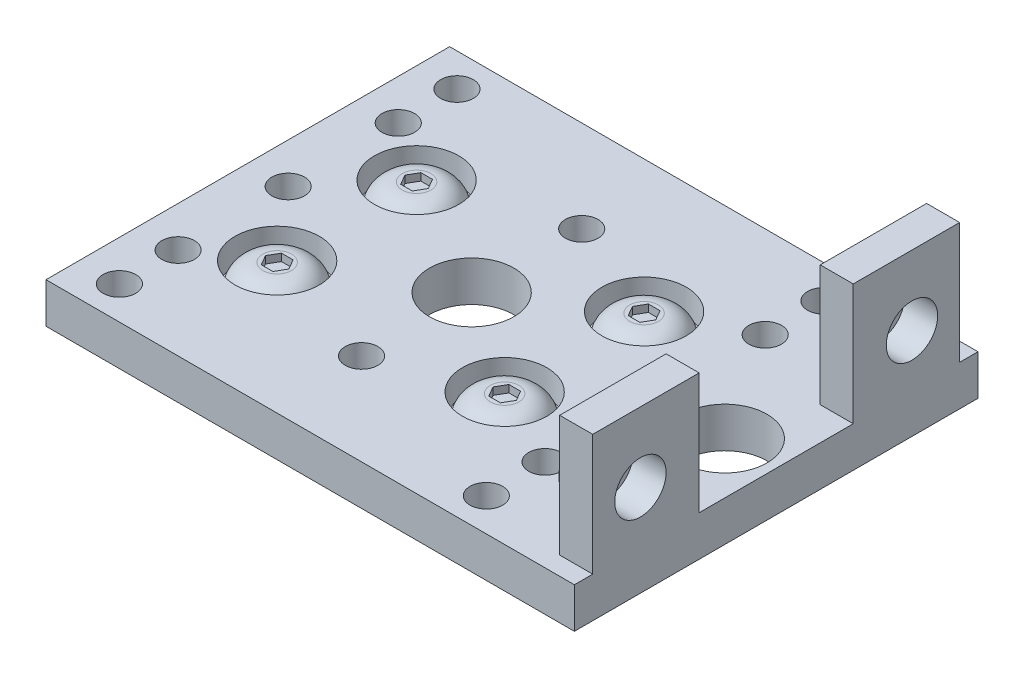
ISO-10303-21;
HEADER;
FILE_DESCRIPTION(('STEP AP214'),'2;1');
FILE_NAME('part.step','',(''),(''),'','','');
FILE_SCHEMA(('AUTOMOTIVE_DESIGN { 1 0 10303 214 1 1 1 1 }'));
ENDSEC;
DATA;
#1=APPLICATION_CONTEXT('core data for automotive mechanical design processes');
#2=APPLICATION_PROTOCOL_DEFINITION('international standard','automotive_design',2000,#1);
#3=PRODUCT_CONTEXT('',#1,'mechanical');
#4=PRODUCT('Part','Part','',(#3));
#5=PRODUCT_RELATED_PRODUCT_CATEGORY('part','',(#4));
#6=PRODUCT_DEFINITION_FORMATION('','',#4);
#7=PRODUCT_DEFINITION_CONTEXT('part definition',#1,'design');
#8=PRODUCT_DEFINITION('design','',#6,#7);
#9=PRODUCT_DEFINITION_SHAPE('','',#8);
#10=(LENGTH_UNIT() NAMED_UNIT(*) SI_UNIT(.MILLI.,.METRE.));
#11=(NAMED_UNIT(*) PLANE_ANGLE_UNIT() SI_UNIT($,.RADIAN.));
#12=(NAMED_UNIT(*) SI_UNIT($,.STERADIAN.) SOLID_ANGLE_UNIT());
#13=UNCERTAINTY_MEASURE_WITH_UNIT(LENGTH_MEASURE(1.E-05),#10,'distance_accuracy_value','');
#14=(GEOMETRIC_REPRESENTATION_CONTEXT(3) GLOBAL_UNCERTAINTY_ASSIGNED_CONTEXT((#13)) GLOBAL_UNIT_ASSIGNED_CONTEXT((#10,
#11,#12)) REPRESENTATION_CONTEXT('',''));
#15=CARTESIAN_POINT('',(0.,0.,0.));
#16=DIRECTION('',(0.,0.,1.));
#17=DIRECTION('',(1.,0.,0.));
#18=AXIS2_PLACEMENT_3D('',#15,#16,#17);
#19=CARTESIAN_POINT('',(0.,2.794,0.));
#20=DIRECTION('',(0.,-1.,0.));
#21=DIRECTION('',(0.,0.,-1.));
#22=AXIS2_PLACEMENT_3D('',#19,#20,#21);
#23=PLANE('',#22);
#24=CARTESIAN_POINT('',(14.732,2.794,0.));
#25=DIRECTION('',(0.,1.,0.));
#26=DIRECTION('',(0.,0.,1.));
#27=AXIS2_PLACEMENT_3D('',#24,#25,#26);
#28=CIRCLE('',#27,2.921);
#29=CARTESIAN_POINT('',(14.732,2.794,2.921));
#30=VERTEX_POINT('',#29);
#31=EDGE_CURVE('E667',#30,#30,#28,.T.);
#32=ORIENTED_EDGE('',*,*,#31,.F.);
#33=EDGE_LOOP('',(#32));
#34=FACE_BOUND('',#33,.T.);
#35=CARTESIAN_POINT('',(-2.794,2.794,0.));
#36=DIRECTION('',(0.,1.,0.));
#37=DIRECTION('',(0.,0.,1.));
#38=AXIS2_PLACEMENT_3D('',#35,#36,#37);
#39=CIRCLE('',#38,2.921);
#40=CARTESIAN_POINT('',(-2.794,2.794,2.921));
#41=VERTEX_POINT('',#40);
#42=EDGE_CURVE('E662',#41,#41,#39,.T.);
#43=ORIENTED_EDGE('',*,*,#42,.F.);
#44=EDGE_LOOP('',(#43));
#45=FACE_BOUND('',#44,.T.);
#46=CARTESIAN_POINT('',(-11.43,2.794,4.826));
#47=DIRECTION('',(0.,1.,0.));
#48=DIRECTION('',(0.,0.,1.));
#49=AXIS2_PLACEMENT_3D('',#46,#47,#48);
#50=CIRCLE('',#49,2.921);
#51=CARTESIAN_POINT('',(-11.43,2.794,7.747));
#52=VERTEX_POINT('',#51);
#53=EDGE_CURVE('E686',#52,#52,#50,.T.);
#54=ORIENTED_EDGE('',*,*,#53,.F.);
#55=EDGE_LOOP('',(#54));
#56=FACE_BOUND('',#55,.T.);
#57=CARTESIAN_POINT('',(4.318,2.794,4.826));
#58=DIRECTION('',(0.,1.,0.));
#59=DIRECTION('',(0.,0.,1.));
#60=AXIS2_PLACEMENT_3D('',#57,#58,#59);
#61=CIRCLE('',#60,2.921);
#62=CARTESIAN_POINT('',(4.318,2.794,7.747));
#63=VERTEX_POINT('',#62);
#64=EDGE_CURVE('E697',#63,#63,#61,.T.);
#65=ORIENTED_EDGE('',*,*,#64,.F.);
#66=EDGE_LOOP('',(#65));
#67=FACE_BOUND('',#66,.T.);
#68=CARTESIAN_POINT('',(4.318,2.794,-4.82600000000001));
#69=DIRECTION('',(0.,1.,0.));
#70=DIRECTION('',(0.,0.,1.));
#71=AXIS2_PLACEMENT_3D('',#68,#69,#70);
#72=CIRCLE('',#71,2.921);
#73=CARTESIAN_POINT('',(4.318,2.794,-1.90500000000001));
#74=VERTEX_POINT('',#73);
#75=EDGE_CURVE('E691',#74,#74,#72,.T.);
#76=ORIENTED_EDGE('',*,*,#75,.F.);
#77=EDGE_LOOP('',(#76));
#78=FACE_BOUND('',#77,.T.);
#79=CARTESIAN_POINT('',(-11.43,2.794,-4.826));
#80=DIRECTION('',(0.,1.,0.));
#81=DIRECTION('',(0.,0.,1.));
#82=AXIS2_PLACEMENT_3D('',#79,#80,#81);
#83=CIRCLE('',#82,2.921);
#84=CARTESIAN_POINT('',(-11.43,2.794,-1.905));
#85=VERTEX_POINT('',#84);
#86=EDGE_CURVE('E690',#85,#85,#83,.T.);
#87=ORIENTED_EDGE('',*,*,#86,.F.);
#88=EDGE_LOOP('',(#87));
#89=FACE_BOUND('',#88,.T.);
#90=CARTESIAN_POINT('',(-15.494,2.794,-11.684));
#91=DIRECTION('',(0.,1.,0.));
#92=DIRECTION('',(0.,0.,1.));
#93=AXIS2_PLACEMENT_3D('',#90,#91,#92);
#94=CIRCLE('',#93,1.13029999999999);
#95=CARTESIAN_POINT('',(-15.494,2.794,-10.5537));
#96=VERTEX_POINT('',#95);
#97=EDGE_CURVE('E708',#96,#96,#94,.T.);
#98=ORIENTED_EDGE('',*,*,#97,.F.);
#99=EDGE_LOOP('',(#98));
#100=FACE_BOUND('',#99,.T.);
#101=CARTESIAN_POINT('',(-15.494,2.794,-7.62));
#102=DIRECTION('',(0.,1.,0.));
#103=DIRECTION('',(0.,0.,1.));
#104=AXIS2_PLACEMENT_3D('',#101,#102,#103);
#105=CIRCLE('',#104,1.13029999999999);
#106=CARTESIAN_POINT('',(-15.494,2.794,-6.48970000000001));
#107=VERTEX_POINT('',#106);
#108=EDGE_CURVE('E716',#107,#107,#105,.T.);
#109=ORIENTED_EDGE('',*,*,#108,.F.);
#110=EDGE_LOOP('',(#109));
#111=FACE_BOUND('',#110,.T.);
#112=CARTESIAN_POINT('',(-15.494,2.794,0.));
#113=DIRECTION('',(0.,1.,0.));
#114=DIRECTION('',(0.,0.,1.));
#115=AXIS2_PLACEMENT_3D('',#112,#113,#114);
#116=CIRCLE('',#115,1.13029999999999);
#117=CARTESIAN_POINT('',(-15.494,2.794,1.13029999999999));
#118=VERTEX_POINT('',#117);
#119=EDGE_CURVE('E722',#118,#118,#116,.T.);
#120=ORIENTED_EDGE('',*,*,#119,.F.);
#121=EDGE_LOOP('',(#120));
#122=FACE_BOUND('',#121,.T.);
#123=CARTESIAN_POINT('',(-15.494,2.794,7.62));
#124=DIRECTION('',(0.,1.,0.));
#125=DIRECTION('',(0.,0.,1.));
#126=AXIS2_PLACEMENT_3D('',#123,#124,#125);
#127=CIRCLE('',#126,1.13029999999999);
#128=CARTESIAN_POINT('',(-15.494,2.794,8.75029999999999));
#129=VERTEX_POINT('',#128);
#130=EDGE_CURVE('E728',#129,#129,#127,.T.);
#131=ORIENTED_EDGE('',*,*,#130,.F.);
#132=EDGE_LOOP('',(#131));
#133=FACE_BOUND('',#132,.T.);
#134=CARTESIAN_POINT('',(-15.494,2.794,11.684));
#135=DIRECTION('',(0.,1.,0.));
#136=DIRECTION('',(0.,0.,1.));
#137=AXIS2_PLACEMENT_3D('',#134,#135,#136);
#138=CIRCLE('',#137,1.13029999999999);
#139=CARTESIAN_POINT('',(-15.494,2.794,12.8143));
#140=VERTEX_POINT('',#139);
#141=EDGE_CURVE('E734',#140,#140,#138,.T.);
#142=ORIENTED_EDGE('',*,*,#141,.F.);
#143=EDGE_LOOP('',(#142));
#144=FACE_BOUND('',#143,.T.);
#145=CARTESIAN_POINT('',(9.906,2.794,11.684));
#146=DIRECTION('',(0.,1.,0.));
#147=DIRECTION('',(0.,0.,1.));
#148=AXIS2_PLACEMENT_3D('',#145,#146,#147);
#149=CIRCLE('',#148,1.13029999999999);
#150=CARTESIAN_POINT('',(9.906,2.794,12.8143));
#151=VERTEX_POINT('',#150);
#152=EDGE_CURVE('E740',#151,#151,#149,.T.);
#153=ORIENTED_EDGE('',*,*,#152,.F.);
#154=EDGE_LOOP('',(#153));
#155=FACE_BOUND('',#154,.T.);
#156=CARTESIAN_POINT('',(9.906,2.794,7.62));
#157=DIRECTION('',(0.,1.,0.));
#158=DIRECTION('',(0.,0.,1.));
#159=AXIS2_PLACEMENT_3D('',#156,#157,#158);
#160=CIRCLE('',#159,1.13029999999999);
#161=CARTESIAN_POINT('',(9.906,2.794,8.75029999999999));
#162=VERTEX_POINT('',#161);
#163=EDGE_CURVE('E746',#162,#162,#160,.T.);
#164=ORIENTED_EDGE('',*,*,#163,.F.);
#165=EDGE_LOOP('',(#164));
#166=FACE_BOUND('',#165,.T.);
#167=CARTESIAN_POINT('',(9.906,2.794,0.));
#168=DIRECTION('',(0.,1.,0.));
#169=DIRECTION('',(0.,0.,1.));
#170=AXIS2_PLACEMENT_3D('',#167,#168,#169);
#171=CIRCLE('',#170,1.13029999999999);
#172=CARTESIAN_POINT('',(9.906,2.794,1.13029999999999));
#173=VERTEX_POINT('',#172);
#174=EDGE_CURVE('E752',#173,#173,#171,.T.);
#175=ORIENTED_EDGE('',*,*,#174,.F.);
#176=EDGE_LOOP('',(#175));
#177=FACE_BOUND('',#176,.T.);
#178=CARTESIAN_POINT('',(9.906,2.794,-7.62));
#179=DIRECTION('',(0.,1.,0.));
#180=DIRECTION('',(0.,0.,1.));
#181=AXIS2_PLACEMENT_3D('',#178,#179,#180);
#182=CIRCLE('',#181,1.13029999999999);
#183=CARTESIAN_POINT('',(9.906,2.794,-6.48970000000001));
#184=VERTEX_POINT('',#183);
#185=EDGE_CURVE('E758',#184,#184,#182,.T.);
#186=ORIENTED_EDGE('',*,*,#185,.F.);
#187=EDGE_LOOP('',(#186));
#188=FACE_BOUND('',#187,.T.);
#189=CARTESIAN_POINT('',(9.906,2.794,-11.684));
#190=DIRECTION('',(0.,1.,0.));
#191=DIRECTION('',(0.,0.,1.));
#192=AXIS2_PLACEMENT_3D('',#189,#190,#191);
#193=CIRCLE('',#192,1.13029999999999);
#194=CARTESIAN_POINT('',(9.906,2.794,-10.5537));
#195=VERTEX_POINT('',#194);
#196=EDGE_CURVE('E764',#195,#195,#193,.T.);
#197=ORIENTED_EDGE('',*,*,#196,.F.);
#198=EDGE_LOOP('',(#197));
#199=FACE_BOUND('',#198,.T.);
#200=CARTESIAN_POINT('',(-2.794,2.794,-7.62));
#201=DIRECTION('',(0.,1.,0.));
#202=DIRECTION('',(0.,0.,1.));
#203=AXIS2_PLACEMENT_3D('',#200,#201,#202);
#204=CIRCLE('',#203,1.13029999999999);
#205=CARTESIAN_POINT('',(-2.794,2.794,-6.48970000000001));
#206=VERTEX_POINT('',#205);
#207=EDGE_CURVE('E770',#206,#206,#204,.T.);
#208=ORIENTED_EDGE('',*,*,#207,.F.);
#209=EDGE_LOOP('',(#208));
#210=FACE_BOUND('',#209,.T.);
#211=CARTESIAN_POINT('',(-2.794,2.794,7.62));
#212=DIRECTION('',(0.,1.,0.));
#213=DIRECTION('',(0.,0.,1.));
#214=AXIS2_PLACEMENT_3D('',#211,#212,#213);
#215=CIRCLE('',#214,1.13029999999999);
#216=CARTESIAN_POINT('',(-2.794,2.794,8.75029999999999));
#217=VERTEX_POINT('',#216);
#218=EDGE_CURVE('E776',#217,#217,#215,.T.);
#219=ORIENTED_EDGE('',*,*,#218,.F.);
#220=EDGE_LOOP('',(#219));
#221=FACE_BOUND('',#220,.T.);
#222=DIRECTION('',(-1.,0.,0.));
#223=VECTOR('',#222,1.);
#224=CARTESIAN_POINT('',(0.,2.794,5.33400000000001));
#225=LINE('',#224,#223);
#226=CARTESIAN_POINT('',(18.288,2.794,5.334));
#227=VERTEX_POINT('',#226);
#228=CARTESIAN_POINT('',(16.002,2.794,5.334));
#229=VERTEX_POINT('',#228);
#230=EDGE_CURVE('E817',#227,#229,#225,.T.);
#231=ORIENTED_EDGE('',*,*,#230,.F.);
#232=DIRECTION('',(0.,0.,-1.));
#233=VECTOR('',#232,1.);
#234=CARTESIAN_POINT('',(18.288,2.794,13.97));
#235=LINE('',#234,#233);
#236=CARTESIAN_POINT('',(18.288,2.794,-5.334));
#237=VERTEX_POINT('',#236);
#238=EDGE_CURVE('E854',#227,#237,#235,.T.);
#239=ORIENTED_EDGE('',*,*,#238,.T.);
#240=DIRECTION('',(1.,0.,0.));
#241=VECTOR('',#240,1.);
#242=CARTESIAN_POINT('',(0.,2.794,-5.334));
#243=LINE('',#242,#241);
#244=CARTESIAN_POINT('',(16.002,2.794,-5.334));
#245=VERTEX_POINT('',#244);
#246=EDGE_CURVE('E841',#245,#237,#243,.T.);
#247=ORIENTED_EDGE('',*,*,#246,.F.);
#248=DIRECTION('',(0.,0.,1.));
#249=VECTOR('',#248,1.);
#250=CARTESIAN_POINT('',(16.002,2.794,0.));
#251=LINE('',#250,#249);
#252=CARTESIAN_POINT('',(16.002,2.794,-12.7));
#253=VERTEX_POINT('',#252);
#254=EDGE_CURVE('E844',#253,#245,#251,.T.);
#255=ORIENTED_EDGE('',*,*,#254,.F.);
#256=DIRECTION('',(-1.,0.,0.));
#257=VECTOR('',#256,1.);
#258=CARTESIAN_POINT('',(0.,2.794,-12.7));
#259=LINE('',#258,#257);
#260=CARTESIAN_POINT('',(18.288,2.794,-12.7));
#261=VERTEX_POINT('',#260);
#262=EDGE_CURVE('E847',#261,#253,#259,.T.);
#263=ORIENTED_EDGE('',*,*,#262,.F.);
#264=CARTESIAN_POINT('',(18.288,2.794,-13.97));
#265=VERTEX_POINT('',#264);
#266=EDGE_CURVE('E855',#261,#265,#235,.T.);
#267=ORIENTED_EDGE('',*,*,#266,.T.);
#268=DIRECTION('',(-1.,0.,0.));
#269=VECTOR('',#268,1.);
#270=CARTESIAN_POINT('',(-18.288,2.794,-13.97));
#271=LINE('',#270,#269);
#272=CARTESIAN_POINT('',(-18.288,2.794,-13.97));
#273=VERTEX_POINT('',#272);
#274=EDGE_CURVE('E853',#265,#273,#271,.T.);
#275=ORIENTED_EDGE('',*,*,#274,.T.);
#276=DIRECTION('',(0.,0.,1.));
#277=VECTOR('',#276,1.);
#278=CARTESIAN_POINT('',(-18.288,2.794,13.97));
#279=LINE('',#278,#277);
#280=CARTESIAN_POINT('',(-18.288,2.794,13.97));
#281=VERTEX_POINT('',#280);
#282=EDGE_CURVE('E857',#273,#281,#279,.T.);
#283=ORIENTED_EDGE('',*,*,#282,.T.);
#284=DIRECTION('',(1.,0.,0.));
#285=VECTOR('',#284,1.);
#286=CARTESIAN_POINT('',(-18.288,2.794,13.97));
#287=LINE('',#286,#285);
#288=CARTESIAN_POINT('',(18.288,2.794,13.97));
#289=VERTEX_POINT('',#288);
#290=EDGE_CURVE('E859',#281,#289,#287,.T.);
#291=ORIENTED_EDGE('',*,*,#290,.T.);
#292=CARTESIAN_POINT('',(18.288,2.794,12.7));
#293=VERTEX_POINT('',#292);
#294=EDGE_CURVE('E851',#289,#293,#235,.T.);
#295=ORIENTED_EDGE('',*,*,#294,.T.);
#296=DIRECTION('',(1.,0.,0.));
#297=VECTOR('',#296,1.);
#298=CARTESIAN_POINT('',(0.,2.794,12.7));
#299=LINE('',#298,#297);
#300=CARTESIAN_POINT('',(16.002,2.794,12.7));
#301=VERTEX_POINT('',#300);
#302=EDGE_CURVE('E811',#301,#293,#299,.T.);
#303=ORIENTED_EDGE('',*,*,#302,.F.);
#304=DIRECTION('',(0.,0.,1.));
#305=VECTOR('',#304,1.);
#306=CARTESIAN_POINT('',(16.002,2.794,0.));
#307=LINE('',#306,#305);
#308=EDGE_CURVE('E814',#229,#301,#307,.T.);
#309=ORIENTED_EDGE('',*,*,#308,.F.);
#310=EDGE_LOOP('',(#231,#239,#247,#255,#263,#267,#275,#283,#291,#295,#303,#309));
#311=FACE_BOUND('',#310,.T.);
#312=ADVANCED_FACE('F35',(#34,#45,#56,#67,#78,#89,#100,#111,#122,#133,#144,#155,#166,#177,#188,
#199,#210,#221,#311),#23,.F.);
#313=CARTESIAN_POINT('',(18.288,2.794,13.97));
#314=DIRECTION('',(-1.,0.,0.));
#315=DIRECTION('',(0.,0.,1.));
#316=AXIS2_PLACEMENT_3D('',#313,#314,#315);
#317=PLANE('',#316);
#318=CARTESIAN_POINT('',(18.288,6.35,9.398));
#319=DIRECTION('',(1.,0.,0.));
#320=DIRECTION('',(0.,0.,-1.));
#321=AXIS2_PLACEMENT_3D('',#318,#319,#320);
#322=CIRCLE('',#321,1.778);
#323=CARTESIAN_POINT('',(18.288,6.35,7.62));
#324=VERTEX_POINT('',#323);
#325=EDGE_CURVE('E783',#324,#324,#322,.T.);
#326=ORIENTED_EDGE('',*,*,#325,.F.);
#327=EDGE_LOOP('',(#326));
#328=FACE_BOUND('',#327,.T.);
#329=CARTESIAN_POINT('',(18.288,6.35,-9.398));
#330=DIRECTION('',(1.,0.,0.));
#331=DIRECTION('',(0.,0.,-1.));
#332=AXIS2_PLACEMENT_3D('',#329,#330,#331);
#333=CIRCLE('',#332,1.778);
#334=CARTESIAN_POINT('',(18.288,6.35,-11.176));
#335=VERTEX_POINT('',#334);
#336=EDGE_CURVE('E782',#335,#335,#333,.T.);
#337=ORIENTED_EDGE('',*,*,#336,.F.);
#338=EDGE_LOOP('',(#337));
#339=FACE_BOUND('',#338,.T.);
#340=DIRECTION('',(0.,0.,-1.));
#341=VECTOR('',#340,1.);
#342=CARTESIAN_POINT('',(18.288,0.,13.97));
#343=LINE('',#342,#341);
#344=CARTESIAN_POINT('',(18.288,0.,13.97));
#345=VERTEX_POINT('',#344);
#346=CARTESIAN_POINT('',(18.288,0.,-13.97));
#347=VERTEX_POINT('',#346);
#348=EDGE_CURVE('E850',#345,#347,#343,.T.);
#349=ORIENTED_EDGE('',*,*,#348,.T.);
#350=DIRECTION('',(0.,-1.,0.));
#351=VECTOR('',#350,1.);
#352=CARTESIAN_POINT('',(18.288,2.794,-13.97));
#353=LINE('',#352,#351);
#354=EDGE_CURVE('E877',#265,#347,#353,.T.);
#355=ORIENTED_EDGE('',*,*,#354,.F.);
#356=ORIENTED_EDGE('',*,*,#266,.F.);
#357=DIRECTION('',(0.,-1.,0.));
#358=VECTOR('',#357,1.);
#359=CARTESIAN_POINT('',(18.288,11.176,-12.7));
#360=LINE('',#359,#358);
#361=CARTESIAN_POINT('',(18.288,11.176,-12.7));
#362=VERTEX_POINT('',#361);
#363=EDGE_CURVE('E838',#362,#261,#360,.T.);
#364=ORIENTED_EDGE('',*,*,#363,.F.);
#365=DIRECTION('',(0.,0.,-1.));
#366=VECTOR('',#365,1.);
#367=CARTESIAN_POINT('',(18.288,11.176,-12.7));
#368=LINE('',#367,#366);
#369=CARTESIAN_POINT('',(18.288,11.176,-5.334));
#370=VERTEX_POINT('',#369);
#371=EDGE_CURVE('E820',#370,#362,#368,.T.);
#372=ORIENTED_EDGE('',*,*,#371,.F.);
#373=DIRECTION('',(0.,-1.,0.));
#374=VECTOR('',#373,1.);
#375=CARTESIAN_POINT('',(18.288,11.176,-5.334));
#376=LINE('',#375,#374);
#377=EDGE_CURVE('E829',#370,#237,#376,.T.);
#378=ORIENTED_EDGE('',*,*,#377,.T.);
#379=ORIENTED_EDGE('',*,*,#238,.F.);
#380=DIRECTION('',(0.,-1.,0.));
#381=VECTOR('',#380,1.);
#382=CARTESIAN_POINT('',(18.288,11.176,5.334));
#383=LINE('',#382,#381);
#384=CARTESIAN_POINT('',(18.288,11.176,5.334));
#385=VERTEX_POINT('',#384);
#386=EDGE_CURVE('E808',#385,#227,#383,.T.);
#387=ORIENTED_EDGE('',*,*,#386,.F.);
#388=DIRECTION('',(0.,0.,-1.));
#389=VECTOR('',#388,1.);
#390=CARTESIAN_POINT('',(18.288,11.176,5.334));
#391=LINE('',#390,#389);
#392=CARTESIAN_POINT('',(18.288,11.176,12.7));
#393=VERTEX_POINT('',#392);
#394=EDGE_CURVE('E789',#393,#385,#391,.T.);
#395=ORIENTED_EDGE('',*,*,#394,.F.);
#396=DIRECTION('',(0.,-1.,0.));
#397=VECTOR('',#396,1.);
#398=CARTESIAN_POINT('',(18.288,11.176,12.7));
#399=LINE('',#398,#397);
#400=EDGE_CURVE('E799',#393,#293,#399,.T.);
#401=ORIENTED_EDGE('',*,*,#400,.T.);
#402=ORIENTED_EDGE('',*,*,#294,.F.);
#403=DIRECTION('',(0.,-1.,0.));
#404=VECTOR('',#403,1.);
#405=CARTESIAN_POINT('',(18.288,2.794,13.97));
#406=LINE('',#405,#404);
#407=EDGE_CURVE('E861',#289,#345,#406,.T.);
#408=ORIENTED_EDGE('',*,*,#407,.T.);
#409=EDGE_LOOP('',(#349,#355,#356,#364,#372,#378,#379,#387,#395,#401,#402,#408));
#410=FACE_BOUND('',#409,.T.);
#411=ADVANCED_FACE('F37',(#328,#339,#410),#317,.F.);
#412=CARTESIAN_POINT('',(-18.288,2.794,-13.97));
#413=DIRECTION('',(0.,0.,1.));
#414=DIRECTION('',(1.,0.,0.));
#415=AXIS2_PLACEMENT_3D('',#412,#413,#414);
#416=PLANE('',#415);
#417=DIRECTION('',(-1.,0.,0.));
#418=VECTOR('',#417,1.);
#419=CARTESIAN_POINT('',(-18.288,0.,-13.97));
#420=LINE('',#419,#418);
#421=CARTESIAN_POINT('',(-18.288,0.,-13.97));
#422=VERTEX_POINT('',#421);
#423=EDGE_CURVE('E863',#347,#422,#420,.T.);
#424=ORIENTED_EDGE('',*,*,#423,.T.);
#425=DIRECTION('',(0.,-1.,0.));
#426=VECTOR('',#425,1.);
#427=CARTESIAN_POINT('',(-18.288,2.794,-13.97));
#428=LINE('',#427,#426);
#429=EDGE_CURVE('E874',#273,#422,#428,.T.);
#430=ORIENTED_EDGE('',*,*,#429,.F.);
#431=ORIENTED_EDGE('',*,*,#274,.F.);
#432=ORIENTED_EDGE('',*,*,#354,.T.);
#433=EDGE_LOOP('',(#424,#430,#431,#432));
#434=FACE_BOUND('',#433,.T.);
#435=ADVANCED_FACE('F924',(#434),#416,.F.);
#436=CARTESIAN_POINT('',(-18.288,2.794,13.97));
#437=DIRECTION('',(1.,0.,0.));
#438=DIRECTION('',(0.,0.,-1.));
#439=AXIS2_PLACEMENT_3D('',#436,#437,#438);
#440=PLANE('',#439);
#441=DIRECTION('',(0.,0.,1.));
#442=VECTOR('',#441,1.);
#443=CARTESIAN_POINT('',(-18.288,0.,13.97));
#444=LINE('',#443,#442);
#445=CARTESIAN_POINT('',(-18.288,0.,13.97));
#446=VERTEX_POINT('',#445);
#447=EDGE_CURVE('E865',#422,#446,#444,.T.);
#448=ORIENTED_EDGE('',*,*,#447,.T.);
#449=DIRECTION('',(0.,-1.,0.));
#450=VECTOR('',#449,1.);
#451=CARTESIAN_POINT('',(-18.288,2.794,13.97));
#452=LINE('',#451,#450);
#453=EDGE_CURVE('E871',#281,#446,#452,.T.);
#454=ORIENTED_EDGE('',*,*,#453,.F.);
#455=ORIENTED_EDGE('',*,*,#282,.F.);
#456=ORIENTED_EDGE('',*,*,#429,.T.);
#457=EDGE_LOOP('',(#448,#454,#455,#456));
#458=FACE_BOUND('',#457,.T.);
#459=ADVANCED_FACE('F935',(#458),#440,.F.);
#460=CARTESIAN_POINT('',(-18.288,2.794,13.97));
#461=DIRECTION('',(0.,0.,-1.));
#462=DIRECTION('',(-1.,0.,0.));
#463=AXIS2_PLACEMENT_3D('',#460,#461,#462);
#464=PLANE('',#463);
#465=DIRECTION('',(1.,0.,0.));
#466=VECTOR('',#465,1.);
#467=CARTESIAN_POINT('',(-18.288,0.,13.97));
#468=LINE('',#467,#466);
#469=EDGE_CURVE('E867',#446,#345,#468,.T.);
#470=ORIENTED_EDGE('',*,*,#469,.T.);
#471=ORIENTED_EDGE('',*,*,#407,.F.);
#472=ORIENTED_EDGE('',*,*,#290,.F.);
#473=ORIENTED_EDGE('',*,*,#453,.T.);
#474=EDGE_LOOP('',(#470,#471,#472,#473));
#475=FACE_BOUND('',#474,.T.);
#476=ADVANCED_FACE('F939',(#475),#464,.F.);
#477=CARTESIAN_POINT('',(0.,0.,0.));
#478=DIRECTION('',(0.,-1.,0.));
#479=DIRECTION('',(0.,0.,-1.));
#480=AXIS2_PLACEMENT_3D('',#477,#478,#479);
#481=PLANE('',#480);
#482=CARTESIAN_POINT('',(14.732,0.,0.));
#483=DIRECTION('',(0.,1.,0.));
#484=DIRECTION('',(0.,0.,1.));
#485=AXIS2_PLACEMENT_3D('',#482,#483,#484);
#486=CIRCLE('',#485,2.921);
#487=CARTESIAN_POINT('',(14.732,0.,2.921));
#488=VERTEX_POINT('',#487);
#489=EDGE_CURVE('E663',#488,#488,#486,.T.);
#490=ORIENTED_EDGE('',*,*,#489,.T.);
#491=EDGE_LOOP('',(#490));
#492=FACE_BOUND('',#491,.T.);
#493=CARTESIAN_POINT('',(-2.794,0.,0.));
#494=DIRECTION('',(0.,1.,0.));
#495=DIRECTION('',(0.,0.,1.));
#496=AXIS2_PLACEMENT_3D('',#493,#494,#495);
#497=CIRCLE('',#496,2.921);
#498=CARTESIAN_POINT('',(-2.794,0.,2.921));
#499=VERTEX_POINT('',#498);
#500=EDGE_CURVE('E670',#499,#499,#497,.T.);
#501=ORIENTED_EDGE('',*,*,#500,.T.);
#502=EDGE_LOOP('',(#501));
#503=FACE_BOUND('',#502,.T.);
#504=CARTESIAN_POINT('',(-11.43,0.,4.826));
#505=DIRECTION('',(0.,1.,0.));
#506=DIRECTION('',(0.,0.,1.));
#507=AXIS2_PLACEMENT_3D('',#504,#505,#506);
#508=CIRCLE('',#507,1.524);
#509=CARTESIAN_POINT('',(-11.43,0.,6.35));
#510=VERTEX_POINT('',#509);
#511=EDGE_CURVE('E666',#510,#510,#508,.T.);
#512=ORIENTED_EDGE('',*,*,#511,.T.);
#513=EDGE_LOOP('',(#512));
#514=FACE_BOUND('',#513,.T.);
#515=CARTESIAN_POINT('',(4.318,0.,4.826));
#516=DIRECTION('',(0.,1.,0.));
#517=DIRECTION('',(0.,0.,1.));
#518=AXIS2_PLACEMENT_3D('',#515,#516,#517);
#519=CIRCLE('',#518,1.524);
#520=CARTESIAN_POINT('',(4.318,0.,6.35));
#521=VERTEX_POINT('',#520);
#522=EDGE_CURVE('E679',#521,#521,#519,.T.);
#523=ORIENTED_EDGE('',*,*,#522,.T.);
#524=EDGE_LOOP('',(#523));
#525=FACE_BOUND('',#524,.T.);
#526=CARTESIAN_POINT('',(4.318,0.,-4.82600000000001));
#527=DIRECTION('',(0.,1.,0.));
#528=DIRECTION('',(0.,0.,1.));
#529=AXIS2_PLACEMENT_3D('',#526,#527,#528);
#530=CIRCLE('',#529,1.524);
#531=CARTESIAN_POINT('',(4.318,0.,-3.30200000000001));
#532=VERTEX_POINT('',#531);
#533=EDGE_CURVE('E675',#532,#532,#530,.T.);
#534=ORIENTED_EDGE('',*,*,#533,.T.);
#535=EDGE_LOOP('',(#534));
#536=FACE_BOUND('',#535,.T.);
#537=CARTESIAN_POINT('',(-11.43,0.,-4.826));
#538=DIRECTION('',(0.,1.,0.));
#539=DIRECTION('',(0.,0.,1.));
#540=AXIS2_PLACEMENT_3D('',#537,#538,#539);
#541=CIRCLE('',#540,1.524);
#542=CARTESIAN_POINT('',(-11.43,0.,-3.302));
#543=VERTEX_POINT('',#542);
#544=EDGE_CURVE('E678',#543,#543,#541,.T.);
#545=ORIENTED_EDGE('',*,*,#544,.T.);
#546=EDGE_LOOP('',(#545));
#547=FACE_BOUND('',#546,.T.);
#548=CARTESIAN_POINT('',(-15.494,0.,-11.684));
#549=DIRECTION('',(0.,-1.,0.));
#550=DIRECTION('',(0.,0.,-1.));
#551=AXIS2_PLACEMENT_3D('',#548,#549,#550);
#552=CIRCLE('',#551,1.13029999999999);
#553=CARTESIAN_POINT('',(-15.494,0.,-12.8143));
#554=VERTEX_POINT('',#553);
#555=EDGE_CURVE('E713',#554,#554,#552,.T.);
#556=ORIENTED_EDGE('',*,*,#555,.F.);
#557=EDGE_LOOP('',(#556));
#558=FACE_BOUND('',#557,.T.);
#559=CARTESIAN_POINT('',(-15.494,0.,-7.62));
#560=DIRECTION('',(0.,-1.,0.));
#561=DIRECTION('',(0.,0.,-1.));
#562=AXIS2_PLACEMENT_3D('',#559,#560,#561);
#563=CIRCLE('',#562,1.13029999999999);
#564=CARTESIAN_POINT('',(-15.494,0.,-8.75029999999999));
#565=VERTEX_POINT('',#564);
#566=EDGE_CURVE('E719',#565,#565,#563,.T.);
#567=ORIENTED_EDGE('',*,*,#566,.F.);
#568=EDGE_LOOP('',(#567));
#569=FACE_BOUND('',#568,.T.);
#570=CARTESIAN_POINT('',(-15.494,0.,0.));
#571=DIRECTION('',(0.,-1.,0.));
#572=DIRECTION('',(0.,0.,-1.));
#573=AXIS2_PLACEMENT_3D('',#570,#571,#572);
#574=CIRCLE('',#573,1.13029999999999);
#575=CARTESIAN_POINT('',(-15.494,0.,-1.13029999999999));
#576=VERTEX_POINT('',#575);
#577=EDGE_CURVE('E725',#576,#576,#574,.T.);
#578=ORIENTED_EDGE('',*,*,#577,.F.);
#579=EDGE_LOOP('',(#578));
#580=FACE_BOUND('',#579,.T.);
#581=CARTESIAN_POINT('',(-15.494,0.,7.62));
#582=DIRECTION('',(0.,-1.,0.));
#583=DIRECTION('',(0.,0.,-1.));
#584=AXIS2_PLACEMENT_3D('',#581,#582,#583);
#585=CIRCLE('',#584,1.13029999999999);
#586=CARTESIAN_POINT('',(-15.494,0.,6.48970000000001));
#587=VERTEX_POINT('',#586);
#588=EDGE_CURVE('E731',#587,#587,#585,.T.);
#589=ORIENTED_EDGE('',*,*,#588,.F.);
#590=EDGE_LOOP('',(#589));
#591=FACE_BOUND('',#590,.T.);
#592=CARTESIAN_POINT('',(-15.494,0.,11.684));
#593=DIRECTION('',(0.,-1.,0.));
#594=DIRECTION('',(0.,0.,-1.));
#595=AXIS2_PLACEMENT_3D('',#592,#593,#594);
#596=CIRCLE('',#595,1.13029999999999);
#597=CARTESIAN_POINT('',(-15.494,0.,10.5537));
#598=VERTEX_POINT('',#597);
#599=EDGE_CURVE('E737',#598,#598,#596,.T.);
#600=ORIENTED_EDGE('',*,*,#599,.F.);
#601=EDGE_LOOP('',(#600));
#602=FACE_BOUND('',#601,.T.);
#603=CARTESIAN_POINT('',(9.906,0.,11.684));
#604=DIRECTION('',(0.,-1.,0.));
#605=DIRECTION('',(0.,0.,-1.));
#606=AXIS2_PLACEMENT_3D('',#603,#604,#605);
#607=CIRCLE('',#606,1.13029999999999);
#608=CARTESIAN_POINT('',(9.906,0.,10.5537));
#609=VERTEX_POINT('',#608);
#610=EDGE_CURVE('E743',#609,#609,#607,.T.);
#611=ORIENTED_EDGE('',*,*,#610,.F.);
#612=EDGE_LOOP('',(#611));
#613=FACE_BOUND('',#612,.T.);
#614=CARTESIAN_POINT('',(9.906,0.,7.62));
#615=DIRECTION('',(0.,-1.,0.));
#616=DIRECTION('',(0.,0.,-1.));
#617=AXIS2_PLACEMENT_3D('',#614,#615,#616);
#618=CIRCLE('',#617,1.13029999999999);
#619=CARTESIAN_POINT('',(9.906,0.,6.48970000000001));
#620=VERTEX_POINT('',#619);
#621=EDGE_CURVE('E749',#620,#620,#618,.T.);
#622=ORIENTED_EDGE('',*,*,#621,.F.);
#623=EDGE_LOOP('',(#622));
#624=FACE_BOUND('',#623,.T.);
#625=CARTESIAN_POINT('',(9.906,0.,0.));
#626=DIRECTION('',(0.,-1.,0.));
#627=DIRECTION('',(0.,0.,-1.));
#628=AXIS2_PLACEMENT_3D('',#625,#626,#627);
#629=CIRCLE('',#628,1.13029999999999);
#630=CARTESIAN_POINT('',(9.906,0.,-1.13029999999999));
#631=VERTEX_POINT('',#630);
#632=EDGE_CURVE('E755',#631,#631,#629,.T.);
#633=ORIENTED_EDGE('',*,*,#632,.F.);
#634=EDGE_LOOP('',(#633));
#635=FACE_BOUND('',#634,.T.);
#636=CARTESIAN_POINT('',(9.906,0.,-7.62));
#637=DIRECTION('',(0.,-1.,0.));
#638=DIRECTION('',(0.,0.,-1.));
#639=AXIS2_PLACEMENT_3D('',#636,#637,#638);
#640=CIRCLE('',#639,1.13029999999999);
#641=CARTESIAN_POINT('',(9.906,0.,-8.75029999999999));
#642=VERTEX_POINT('',#641);
#643=EDGE_CURVE('E761',#642,#642,#640,.T.);
#644=ORIENTED_EDGE('',*,*,#643,.F.);
#645=EDGE_LOOP('',(#644));
#646=FACE_BOUND('',#645,.T.);
#647=CARTESIAN_POINT('',(9.906,0.,-11.684));
#648=DIRECTION('',(0.,-1.,0.));
#649=DIRECTION('',(0.,0.,-1.));
#650=AXIS2_PLACEMENT_3D('',#647,#648,#649);
#651=CIRCLE('',#650,1.13029999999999);
#652=CARTESIAN_POINT('',(9.906,0.,-12.8143));
#653=VERTEX_POINT('',#652);
#654=EDGE_CURVE('E767',#653,#653,#651,.T.);
#655=ORIENTED_EDGE('',*,*,#654,.F.);
#656=EDGE_LOOP('',(#655));
#657=FACE_BOUND('',#656,.T.);
#658=CARTESIAN_POINT('',(-2.794,0.,-7.62));
#659=DIRECTION('',(0.,-1.,0.));
#660=DIRECTION('',(0.,0.,-1.));
#661=AXIS2_PLACEMENT_3D('',#658,#659,#660);
#662=CIRCLE('',#661,1.13029999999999);
#663=CARTESIAN_POINT('',(-2.794,0.,-8.75029999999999));
#664=VERTEX_POINT('',#663);
#665=EDGE_CURVE('E773',#664,#664,#662,.T.);
#666=ORIENTED_EDGE('',*,*,#665,.F.);
#667=EDGE_LOOP('',(#666));
#668=FACE_BOUND('',#667,.T.);
#669=CARTESIAN_POINT('',(-2.794,0.,7.62));
#670=DIRECTION('',(0.,-1.,0.));
#671=DIRECTION('',(0.,0.,-1.));
#672=AXIS2_PLACEMENT_3D('',#669,#670,#671);
#673=CIRCLE('',#672,1.13029999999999);
#674=CARTESIAN_POINT('',(-2.794,0.,6.48970000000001));
#675=VERTEX_POINT('',#674);
#676=EDGE_CURVE('E779',#675,#675,#673,.T.);
#677=ORIENTED_EDGE('',*,*,#676,.F.);
#678=EDGE_LOOP('',(#677));
#679=FACE_BOUND('',#678,.T.);
#680=ORIENTED_EDGE('',*,*,#423,.F.);
#681=ORIENTED_EDGE('',*,*,#348,.F.);
#682=ORIENTED_EDGE('',*,*,#469,.F.);
#683=ORIENTED_EDGE('',*,*,#447,.F.);
#684=EDGE_LOOP('',(#680,#681,#682,#683));
#685=FACE_BOUND('',#684,.T.);
#686=ADVANCED_FACE('F933',(#492,#503,#514,#525,#536,#547,#558,#569,#580,#591,#602,#613,#624,
#635,#646,#657,#668,#679,#685),#481,.T.);
#687=CARTESIAN_POINT('',(18.288,11.176,-12.7));
#688=DIRECTION('',(0.,0.,1.));
#689=DIRECTION('',(1.,0.,0.));
#690=AXIS2_PLACEMENT_3D('',#687,#688,#689);
#691=PLANE('',#690);
#692=ORIENTED_EDGE('',*,*,#363,.T.);
#693=ORIENTED_EDGE('',*,*,#262,.T.);
#694=DIRECTION('',(0.,-1.,0.));
#695=VECTOR('',#694,1.);
#696=CARTESIAN_POINT('',(16.002,11.176,-12.7));
#697=LINE('',#696,#695);
#698=CARTESIAN_POINT('',(16.002,11.176,-12.7));
#699=VERTEX_POINT('',#698);
#700=EDGE_CURVE('E835',#699,#253,#697,.T.);
#701=ORIENTED_EDGE('',*,*,#700,.F.);
#702=DIRECTION('',(-1.,0.,0.));
#703=VECTOR('',#702,1.);
#704=CARTESIAN_POINT('',(18.288,11.176,-12.7));
#705=LINE('',#704,#703);
#706=EDGE_CURVE('E823',#362,#699,#705,.T.);
#707=ORIENTED_EDGE('',*,*,#706,.F.);
#708=EDGE_LOOP('',(#692,#693,#701,#707));
#709=FACE_BOUND('',#708,.T.);
#710=ADVANCED_FACE('F968',(#709),#691,.F.);
#711=CARTESIAN_POINT('',(16.002,11.176,-12.7));
#712=DIRECTION('',(1.,0.,0.));
#713=DIRECTION('',(0.,0.,-1.));
#714=AXIS2_PLACEMENT_3D('',#711,#712,#713);
#715=PLANE('',#714);
#716=CARTESIAN_POINT('',(16.002,6.35,-9.398));
#717=DIRECTION('',(1.,0.,0.));
#718=DIRECTION('',(0.,0.,-1.));
#719=AXIS2_PLACEMENT_3D('',#716,#717,#718);
#720=CIRCLE('',#719,2.667);
#721=CARTESIAN_POINT('',(16.002,6.35,-12.065));
#722=VERTEX_POINT('',#721);
#723=EDGE_CURVE('E11',#722,#722,#720,.F.);
#724=ORIENTED_EDGE('',*,*,#723,.F.);
#725=EDGE_LOOP('',(#724));
#726=FACE_BOUND('',#725,.T.);
#727=ORIENTED_EDGE('',*,*,#700,.T.);
#728=ORIENTED_EDGE('',*,*,#254,.T.);
#729=DIRECTION('',(0.,-1.,0.));
#730=VECTOR('',#729,1.);
#731=CARTESIAN_POINT('',(16.002,11.176,-5.334));
#732=LINE('',#731,#730);
#733=CARTESIAN_POINT('',(16.002,11.176,-5.334));
#734=VERTEX_POINT('',#733);
#735=EDGE_CURVE('E832',#734,#245,#732,.T.);
#736=ORIENTED_EDGE('',*,*,#735,.F.);
#737=DIRECTION('',(0.,0.,1.));
#738=VECTOR('',#737,1.);
#739=CARTESIAN_POINT('',(16.002,11.176,-12.7));
#740=LINE('',#739,#738);
#741=EDGE_CURVE('E825',#699,#734,#740,.T.);
#742=ORIENTED_EDGE('',*,*,#741,.F.);
#743=EDGE_LOOP('',(#727,#728,#736,#742));
#744=FACE_BOUND('',#743,.T.);
#745=ADVANCED_FACE('F1000',(#726,#744),#715,.F.);
#746=CARTESIAN_POINT('',(18.288,11.176,-5.334));
#747=DIRECTION('',(0.,0.,-1.));
#748=DIRECTION('',(-1.,0.,0.));
#749=AXIS2_PLACEMENT_3D('',#746,#747,#748);
#750=PLANE('',#749);
#751=ORIENTED_EDGE('',*,*,#735,.T.);
#752=ORIENTED_EDGE('',*,*,#246,.T.);
#753=ORIENTED_EDGE('',*,*,#377,.F.);
#754=DIRECTION('',(1.,0.,0.));
#755=VECTOR('',#754,1.);
#756=CARTESIAN_POINT('',(18.288,11.176,-5.334));
#757=LINE('',#756,#755);
#758=EDGE_CURVE('E827',#734,#370,#757,.T.);
#759=ORIENTED_EDGE('',*,*,#758,.F.);
#760=EDGE_LOOP('',(#751,#752,#753,#759));
#761=FACE_BOUND('',#760,.T.);
#762=ADVANCED_FACE('F1008',(#761),#750,.F.);
#763=CARTESIAN_POINT('',(0.,11.176,0.));
#764=DIRECTION('',(0.,-1.,0.));
#765=DIRECTION('',(0.,0.,-1.));
#766=AXIS2_PLACEMENT_3D('',#763,#764,#765);
#767=PLANE('',#766);
#768=ORIENTED_EDGE('',*,*,#371,.T.);
#769=ORIENTED_EDGE('',*,*,#706,.T.);
#770=ORIENTED_EDGE('',*,*,#741,.T.);
#771=ORIENTED_EDGE('',*,*,#758,.T.);
#772=EDGE_LOOP('',(#768,#769,#770,#771));
#773=FACE_BOUND('',#772,.T.);
#774=ADVANCED_FACE('F1016',(#773),#767,.F.);
#775=CARTESIAN_POINT('',(18.288,11.176,5.334));
#776=DIRECTION('',(0.,0.,1.));
#777=DIRECTION('',(1.,0.,0.));
#778=AXIS2_PLACEMENT_3D('',#775,#776,#777);
#779=PLANE('',#778);
#780=ORIENTED_EDGE('',*,*,#386,.T.);
#781=ORIENTED_EDGE('',*,*,#230,.T.);
#782=DIRECTION('',(0.,-1.,0.));
#783=VECTOR('',#782,1.);
#784=CARTESIAN_POINT('',(16.002,11.176,5.334));
#785=LINE('',#784,#783);
#786=CARTESIAN_POINT('',(16.002,11.176,5.334));
#787=VERTEX_POINT('',#786);
#788=EDGE_CURVE('E805',#787,#229,#785,.T.);
#789=ORIENTED_EDGE('',*,*,#788,.F.);
#790=DIRECTION('',(-1.,0.,0.));
#791=VECTOR('',#790,1.);
#792=CARTESIAN_POINT('',(18.288,11.176,5.334));
#793=LINE('',#792,#791);
#794=EDGE_CURVE('E792',#385,#787,#793,.T.);
#795=ORIENTED_EDGE('',*,*,#794,.F.);
#796=EDGE_LOOP('',(#780,#781,#789,#795));
#797=FACE_BOUND('',#796,.T.);
#798=ADVANCED_FACE('F905',(#797),#779,.F.);
#799=CARTESIAN_POINT('',(16.002,11.176,5.334));
#800=DIRECTION('',(1.,0.,0.));
#801=DIRECTION('',(0.,0.,-1.));
#802=AXIS2_PLACEMENT_3D('',#799,#800,#801);
#803=PLANE('',#802);
#804=CARTESIAN_POINT('',(16.002,6.35,9.398));
#805=DIRECTION('',(1.,0.,0.));
#806=DIRECTION('',(0.,0.,-1.));
#807=AXIS2_PLACEMENT_3D('',#804,#805,#806);
#808=CIRCLE('',#807,2.667);
#809=CARTESIAN_POINT('',(16.002,6.35,6.731));
#810=VERTEX_POINT('',#809);
#811=EDGE_CURVE('E43',#810,#810,#808,.F.);
#812=ORIENTED_EDGE('',*,*,#811,.F.);
#813=EDGE_LOOP('',(#812));
#814=FACE_BOUND('',#813,.T.);
#815=ORIENTED_EDGE('',*,*,#788,.T.);
#816=ORIENTED_EDGE('',*,*,#308,.T.);
#817=DIRECTION('',(0.,-1.,0.));
#818=VECTOR('',#817,1.);
#819=CARTESIAN_POINT('',(16.002,11.176,12.7));
#820=LINE('',#819,#818);
#821=CARTESIAN_POINT('',(16.002,11.176,12.7));
#822=VERTEX_POINT('',#821);
#823=EDGE_CURVE('E802',#822,#301,#820,.T.);
#824=ORIENTED_EDGE('',*,*,#823,.F.);
#825=DIRECTION('',(0.,0.,1.));
#826=VECTOR('',#825,1.);
#827=CARTESIAN_POINT('',(16.002,11.176,5.334));
#828=LINE('',#827,#826);
#829=EDGE_CURVE('E795',#787,#822,#828,.T.);
#830=ORIENTED_EDGE('',*,*,#829,.F.);
#831=EDGE_LOOP('',(#815,#816,#824,#830));
#832=FACE_BOUND('',#831,.T.);
#833=ADVANCED_FACE('F901',(#814,#832),#803,.F.);
#834=CARTESIAN_POINT('',(18.288,11.176,12.7));
#835=DIRECTION('',(0.,0.,-1.));
#836=DIRECTION('',(-1.,0.,0.));
#837=AXIS2_PLACEMENT_3D('',#834,#835,#836);
#838=PLANE('',#837);
#839=ORIENTED_EDGE('',*,*,#823,.T.);
#840=ORIENTED_EDGE('',*,*,#302,.T.);
#841=ORIENTED_EDGE('',*,*,#400,.F.);
#842=DIRECTION('',(1.,0.,0.));
#843=VECTOR('',#842,1.);
#844=CARTESIAN_POINT('',(18.288,11.176,12.7));
#845=LINE('',#844,#843);
#846=EDGE_CURVE('E797',#822,#393,#845,.T.);
#847=ORIENTED_EDGE('',*,*,#846,.F.);
#848=EDGE_LOOP('',(#839,#840,#841,#847));
#849=FACE_BOUND('',#848,.T.);
#850=ADVANCED_FACE('F904',(#849),#838,.F.);
#851=CARTESIAN_POINT('',(0.,11.176,0.));
#852=DIRECTION('',(0.,-1.,0.));
#853=DIRECTION('',(0.,0.,-1.));
#854=AXIS2_PLACEMENT_3D('',#851,#852,#853);
#855=PLANE('',#854);
#856=ORIENTED_EDGE('',*,*,#394,.T.);
#857=ORIENTED_EDGE('',*,*,#794,.T.);
#858=ORIENTED_EDGE('',*,*,#829,.T.);
#859=ORIENTED_EDGE('',*,*,#846,.T.);
#860=EDGE_LOOP('',(#856,#857,#858,#859));
#861=FACE_BOUND('',#860,.T.);
#862=ADVANCED_FACE('F944',(#861),#855,.F.);
#863=CARTESIAN_POINT('',(-18.288,6.35,9.398));
#864=DIRECTION('',(1.,0.,0.));
#865=DIRECTION('',(0.,0.,-1.));
#866=AXIS2_PLACEMENT_3D('',#863,#864,#865);
#867=CYLINDRICAL_SURFACE('',#866,1.778);
#868=ORIENTED_EDGE('',*,*,#325,.T.);
#869=EDGE_LOOP('',(#868));
#870=FACE_BOUND('',#869,.T.);
#871=CARTESIAN_POINT('',(16.002,6.35,9.398));
#872=DIRECTION('',(1.,0.,0.));
#873=DIRECTION('',(0.,0.,-1.));
#874=AXIS2_PLACEMENT_3D('',#871,#872,#873);
#875=CIRCLE('',#874,1.778);
#876=CARTESIAN_POINT('',(16.002,6.35,7.62));
#877=VERTEX_POINT('',#876);
#878=EDGE_CURVE('E786',#877,#877,#875,.T.);
#879=ORIENTED_EDGE('',*,*,#878,.F.);
#880=EDGE_LOOP('',(#879));
#881=FACE_BOUND('',#880,.T.);
#882=ADVANCED_FACE('F946',(#870,#881),#867,.F.);
#883=CARTESIAN_POINT('',(-18.288,6.35,-9.398));
#884=DIRECTION('',(1.,0.,0.));
#885=DIRECTION('',(0.,0.,-1.));
#886=AXIS2_PLACEMENT_3D('',#883,#884,#885);
#887=CYLINDRICAL_SURFACE('',#886,1.778);
#888=ORIENTED_EDGE('',*,*,#336,.T.);
#889=EDGE_LOOP('',(#888));
#890=FACE_BOUND('',#889,.T.);
#891=CARTESIAN_POINT('',(16.002,6.35,-9.398));
#892=DIRECTION('',(1.,0.,0.));
#893=DIRECTION('',(0.,0.,-1.));
#894=AXIS2_PLACEMENT_3D('',#891,#892,#893);
#895=CIRCLE('',#894,1.778);
#896=CARTESIAN_POINT('',(16.002,6.35,-11.176));
#897=VERTEX_POINT('',#896);
#898=EDGE_CURVE('E793',#897,#897,#895,.T.);
#899=ORIENTED_EDGE('',*,*,#898,.F.);
#900=EDGE_LOOP('',(#899));
#901=FACE_BOUND('',#900,.T.);
#902=ADVANCED_FACE('F952',(#890,#901),#887,.F.);
#903=CARTESIAN_POINT('',(-2.794,2.794,7.62));
#904=DIRECTION('',(0.,1.,0.));
#905=DIRECTION('',(0.,0.,1.));
#906=AXIS2_PLACEMENT_3D('',#903,#904,#905);
#907=CYLINDRICAL_SURFACE('',#906,1.13029999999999);
#908=ORIENTED_EDGE('',*,*,#676,.T.);
#909=EDGE_LOOP('',(#908));
#910=FACE_BOUND('',#909,.T.);
#911=ORIENTED_EDGE('',*,*,#218,.T.);
#912=EDGE_LOOP('',(#911));
#913=FACE_BOUND('',#912,.T.);
#914=ADVANCED_FACE('F1065',(#910,#913),#907,.F.);
#915=CARTESIAN_POINT('',(-2.794,2.794,-7.62));
#916=DIRECTION('',(0.,1.,0.));
#917=DIRECTION('',(0.,0.,1.));
#918=AXIS2_PLACEMENT_3D('',#915,#916,#917);
#919=CYLINDRICAL_SURFACE('',#918,1.13029999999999);
#920=ORIENTED_EDGE('',*,*,#665,.T.);
#921=EDGE_LOOP('',(#920));
#922=FACE_BOUND('',#921,.T.);
#923=ORIENTED_EDGE('',*,*,#207,.T.);
#924=EDGE_LOOP('',(#923));
#925=FACE_BOUND('',#924,.T.);
#926=ADVANCED_FACE('F1075',(#922,#925),#919,.F.);
#927=CARTESIAN_POINT('',(9.906,2.794,-11.684));
#928=DIRECTION('',(0.,1.,0.));
#929=DIRECTION('',(0.,0.,1.));
#930=AXIS2_PLACEMENT_3D('',#927,#928,#929);
#931=CYLINDRICAL_SURFACE('',#930,1.13029999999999);
#932=ORIENTED_EDGE('',*,*,#654,.T.);
#933=EDGE_LOOP('',(#932));
#934=FACE_BOUND('',#933,.T.);
#935=ORIENTED_EDGE('',*,*,#196,.T.);
#936=EDGE_LOOP('',(#935));
#937=FACE_BOUND('',#936,.T.);
#938=ADVANCED_FACE('F1086',(#934,#937),#931,.F.);
#939=CARTESIAN_POINT('',(9.906,2.794,-7.62));
#940=DIRECTION('',(0.,1.,0.));
#941=DIRECTION('',(0.,0.,1.));
#942=AXIS2_PLACEMENT_3D('',#939,#940,#941);
#943=CYLINDRICAL_SURFACE('',#942,1.13029999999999);
#944=ORIENTED_EDGE('',*,*,#643,.T.);
#945=EDGE_LOOP('',(#944));
#946=FACE_BOUND('',#945,.T.);
#947=ORIENTED_EDGE('',*,*,#185,.T.);
#948=EDGE_LOOP('',(#947));
#949=FACE_BOUND('',#948,.T.);
#950=ADVANCED_FACE('F1097',(#946,#949),#943,.F.);
#951=CARTESIAN_POINT('',(9.906,2.794,0.));
#952=DIRECTION('',(0.,1.,0.));
#953=DIRECTION('',(0.,0.,1.));
#954=AXIS2_PLACEMENT_3D('',#951,#952,#953);
#955=CYLINDRICAL_SURFACE('',#954,1.13029999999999);
#956=ORIENTED_EDGE('',*,*,#632,.T.);
#957=EDGE_LOOP('',(#956));
#958=FACE_BOUND('',#957,.T.);
#959=ORIENTED_EDGE('',*,*,#174,.T.);
#960=EDGE_LOOP('',(#959));
#961=FACE_BOUND('',#960,.T.);
#962=ADVANCED_FACE('F1108',(#958,#961),#955,.F.);
#963=CARTESIAN_POINT('',(9.906,2.794,7.62));
#964=DIRECTION('',(0.,1.,0.));
#965=DIRECTION('',(0.,0.,1.));
#966=AXIS2_PLACEMENT_3D('',#963,#964,#965);
#967=CYLINDRICAL_SURFACE('',#966,1.13029999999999);
#968=ORIENTED_EDGE('',*,*,#621,.T.);
#969=EDGE_LOOP('',(#968));
#970=FACE_BOUND('',#969,.T.);
#971=ORIENTED_EDGE('',*,*,#163,.T.);
#972=EDGE_LOOP('',(#971));
#973=FACE_BOUND('',#972,.T.);
#974=ADVANCED_FACE('F1119',(#970,#973),#967,.F.);
#975=CARTESIAN_POINT('',(9.906,2.794,11.684));
#976=DIRECTION('',(0.,1.,0.));
#977=DIRECTION('',(0.,0.,1.));
#978=AXIS2_PLACEMENT_3D('',#975,#976,#977);
#979=CYLINDRICAL_SURFACE('',#978,1.13029999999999);
#980=ORIENTED_EDGE('',*,*,#610,.T.);
#981=EDGE_LOOP('',(#980));
#982=FACE_BOUND('',#981,.T.);
#983=ORIENTED_EDGE('',*,*,#152,.T.);
#984=EDGE_LOOP('',(#983));
#985=FACE_BOUND('',#984,.T.);
#986=ADVANCED_FACE('F1130',(#982,#985),#979,.F.);
#987=CARTESIAN_POINT('',(-15.494,2.794,11.684));
#988=DIRECTION('',(0.,1.,0.));
#989=DIRECTION('',(0.,0.,1.));
#990=AXIS2_PLACEMENT_3D('',#987,#988,#989);
#991=CYLINDRICAL_SURFACE('',#990,1.13029999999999);
#992=ORIENTED_EDGE('',*,*,#599,.T.);
#993=EDGE_LOOP('',(#992));
#994=FACE_BOUND('',#993,.T.);
#995=ORIENTED_EDGE('',*,*,#141,.T.);
#996=EDGE_LOOP('',(#995));
#997=FACE_BOUND('',#996,.T.);
#998=ADVANCED_FACE('F1141',(#994,#997),#991,.F.);
#999=CARTESIAN_POINT('',(-15.494,2.794,7.62));
#1000=DIRECTION('',(0.,1.,0.));
#1001=DIRECTION('',(0.,0.,1.));
#1002=AXIS2_PLACEMENT_3D('',#999,#1000,#1001);
#1003=CYLINDRICAL_SURFACE('',#1002,1.13029999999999);
#1004=ORIENTED_EDGE('',*,*,#588,.T.);
#1005=EDGE_LOOP('',(#1004));
#1006=FACE_BOUND('',#1005,.T.);
#1007=ORIENTED_EDGE('',*,*,#130,.T.);
#1008=EDGE_LOOP('',(#1007));
#1009=FACE_BOUND('',#1008,.T.);
#1010=ADVANCED_FACE('F1152',(#1006,#1009),#1003,.F.);
#1011=CARTESIAN_POINT('',(-15.494,2.794,0.));
#1012=DIRECTION('',(0.,1.,0.));
#1013=DIRECTION('',(0.,0.,1.));
#1014=AXIS2_PLACEMENT_3D('',#1011,#1012,#1013);
#1015=CYLINDRICAL_SURFACE('',#1014,1.13029999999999);
#1016=ORIENTED_EDGE('',*,*,#577,.T.);
#1017=EDGE_LOOP('',(#1016));
#1018=FACE_BOUND('',#1017,.T.);
#1019=ORIENTED_EDGE('',*,*,#119,.T.);
#1020=EDGE_LOOP('',(#1019));
#1021=FACE_BOUND('',#1020,.T.);
#1022=ADVANCED_FACE('F1163',(#1018,#1021),#1015,.F.);
#1023=CARTESIAN_POINT('',(-15.494,2.794,-7.62));
#1024=DIRECTION('',(0.,1.,0.));
#1025=DIRECTION('',(0.,0.,1.));
#1026=AXIS2_PLACEMENT_3D('',#1023,#1024,#1025);
#1027=CYLINDRICAL_SURFACE('',#1026,1.13029999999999);
#1028=ORIENTED_EDGE('',*,*,#566,.T.);
#1029=EDGE_LOOP('',(#1028));
#1030=FACE_BOUND('',#1029,.T.);
#1031=ORIENTED_EDGE('',*,*,#108,.T.);
#1032=EDGE_LOOP('',(#1031));
#1033=FACE_BOUND('',#1032,.T.);
#1034=ADVANCED_FACE('F1174',(#1030,#1033),#1027,.F.);
#1035=CARTESIAN_POINT('',(-15.494,2.794,-11.684));
#1036=DIRECTION('',(0.,1.,0.));
#1037=DIRECTION('',(0.,0.,1.));
#1038=AXIS2_PLACEMENT_3D('',#1035,#1036,#1037);
#1039=CYLINDRICAL_SURFACE('',#1038,1.13029999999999);
#1040=ORIENTED_EDGE('',*,*,#555,.T.);
#1041=EDGE_LOOP('',(#1040));
#1042=FACE_BOUND('',#1041,.T.);
#1043=ORIENTED_EDGE('',*,*,#97,.T.);
#1044=EDGE_LOOP('',(#1043));
#1045=FACE_BOUND('',#1044,.T.);
#1046=ADVANCED_FACE('F1185',(#1042,#1045),#1039,.F.);
#1047=CARTESIAN_POINT('',(-11.43,1.016,-4.826));
#1048=DIRECTION('',(0.,1.,0.));
#1049=DIRECTION('',(0.,0.,1.));
#1050=AXIS2_PLACEMENT_3D('',#1047,#1048,#1049);
#1051=CYLINDRICAL_SURFACE('',#1050,2.921);
#1052=CARTESIAN_POINT('',(-11.43,1.016,-4.826));
#1053=DIRECTION('',(0.,1.,0.));
#1054=DIRECTION('',(0.,0.,1.));
#1055=AXIS2_PLACEMENT_3D('',#1052,#1053,#1054);
#1056=CIRCLE('',#1055,2.921);
#1057=CARTESIAN_POINT('',(-11.43,1.016,-1.905));
#1058=VERTEX_POINT('',#1057);
#1059=EDGE_CURVE('E705',#1058,#1058,#1056,.T.);
#1060=ORIENTED_EDGE('',*,*,#1059,.F.);
#1061=EDGE_LOOP('',(#1060));
#1062=FACE_BOUND('',#1061,.T.);
#1063=ORIENTED_EDGE('',*,*,#86,.T.);
#1064=EDGE_LOOP('',(#1063));
#1065=FACE_BOUND('',#1064,.T.);
#1066=ADVANCED_FACE('F1196',(#1062,#1065),#1051,.F.);
#1067=CARTESIAN_POINT('',(-11.43,1.016,-4.826));
#1068=DIRECTION('',(0.,1.,0.));
#1069=DIRECTION('',(0.,0.,1.));
#1070=AXIS2_PLACEMENT_3D('',#1067,#1068,#1069);
#1071=PLANE('',#1070);
#1072=CARTESIAN_POINT('',(-11.43,1.016,-4.826));
#1073=DIRECTION('',(0.,1.,0.));
#1074=DIRECTION('',(0.,0.,1.));
#1075=AXIS2_PLACEMENT_3D('',#1072,#1073,#1074);
#1076=CIRCLE('',#1075,2.667);
#1077=CARTESIAN_POINT('',(-11.43,1.016,-2.159));
#1078=VERTEX_POINT('',#1077);
#1079=EDGE_CURVE('E887',#1078,#1078,#1076,.T.);
#1080=ORIENTED_EDGE('',*,*,#1079,.F.);
#1081=EDGE_LOOP('',(#1080));
#1082=FACE_BOUND('',#1081,.T.);
#1083=ORIENTED_EDGE('',*,*,#1059,.T.);
#1084=EDGE_LOOP('',(#1083));
#1085=FACE_BOUND('',#1084,.T.);
#1086=ADVANCED_FACE('F1206',(#1082,#1085),#1071,.T.);
#1087=CARTESIAN_POINT('',(4.318,1.016,-4.82600000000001));
#1088=DIRECTION('',(0.,1.,0.));
#1089=DIRECTION('',(0.,0.,1.));
#1090=AXIS2_PLACEMENT_3D('',#1087,#1088,#1089);
#1091=CYLINDRICAL_SURFACE('',#1090,2.921);
#1092=CARTESIAN_POINT('',(4.318,1.016,-4.82600000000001));
#1093=DIRECTION('',(0.,1.,0.));
#1094=DIRECTION('',(0.,0.,1.));
#1095=AXIS2_PLACEMENT_3D('',#1092,#1093,#1094);
#1096=CIRCLE('',#1095,2.921);
#1097=CARTESIAN_POINT('',(4.318,1.016,-1.90500000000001));
#1098=VERTEX_POINT('',#1097);
#1099=EDGE_CURVE('E687',#1098,#1098,#1096,.T.);
#1100=ORIENTED_EDGE('',*,*,#1099,.F.);
#1101=EDGE_LOOP('',(#1100));
#1102=FACE_BOUND('',#1101,.T.);
#1103=ORIENTED_EDGE('',*,*,#75,.T.);
#1104=EDGE_LOOP('',(#1103));
#1105=FACE_BOUND('',#1104,.T.);
#1106=ADVANCED_FACE('F1214',(#1102,#1105),#1091,.F.);
#1107=CARTESIAN_POINT('',(4.318,1.016,-4.82600000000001));
#1108=DIRECTION('',(0.,1.,0.));
#1109=DIRECTION('',(0.,0.,1.));
#1110=AXIS2_PLACEMENT_3D('',#1107,#1108,#1109);
#1111=PLANE('',#1110);
#1112=CARTESIAN_POINT('',(4.318,1.016,-4.826));
#1113=DIRECTION('',(0.,1.,0.));
#1114=DIRECTION('',(0.,0.,1.));
#1115=AXIS2_PLACEMENT_3D('',#1112,#1113,#1114);
#1116=CIRCLE('',#1115,2.667);
#1117=CARTESIAN_POINT('',(4.318,1.016,-2.159));
#1118=VERTEX_POINT('',#1117);
#1119=EDGE_CURVE('E893',#1118,#1118,#1116,.T.);
#1120=ORIENTED_EDGE('',*,*,#1119,.F.);
#1121=EDGE_LOOP('',(#1120));
#1122=FACE_BOUND('',#1121,.T.);
#1123=ORIENTED_EDGE('',*,*,#1099,.T.);
#1124=EDGE_LOOP('',(#1123));
#1125=FACE_BOUND('',#1124,.T.);
#1126=ADVANCED_FACE('F1219',(#1122,#1125),#1111,.T.);
#1127=CARTESIAN_POINT('',(4.318,1.016,4.826));
#1128=DIRECTION('',(0.,1.,0.));
#1129=DIRECTION('',(0.,0.,1.));
#1130=AXIS2_PLACEMENT_3D('',#1127,#1128,#1129);
#1131=CYLINDRICAL_SURFACE('',#1130,2.921);
#1132=CARTESIAN_POINT('',(4.318,1.016,4.826));
#1133=DIRECTION('',(0.,1.,0.));
#1134=DIRECTION('',(0.,0.,1.));
#1135=AXIS2_PLACEMENT_3D('',#1132,#1133,#1134);
#1136=CIRCLE('',#1135,2.921);
#1137=CARTESIAN_POINT('',(4.318,1.016,7.747));
#1138=VERTEX_POINT('',#1137);
#1139=EDGE_CURVE('E694',#1138,#1138,#1136,.T.);
#1140=ORIENTED_EDGE('',*,*,#1139,.F.);
#1141=EDGE_LOOP('',(#1140));
#1142=FACE_BOUND('',#1141,.T.);
#1143=ORIENTED_EDGE('',*,*,#64,.T.);
#1144=EDGE_LOOP('',(#1143));
#1145=FACE_BOUND('',#1144,.T.);
#1146=ADVANCED_FACE('F1227',(#1142,#1145),#1131,.F.);
#1147=CARTESIAN_POINT('',(4.318,1.016,4.826));
#1148=DIRECTION('',(0.,1.,0.));
#1149=DIRECTION('',(0.,0.,1.));
#1150=AXIS2_PLACEMENT_3D('',#1147,#1148,#1149);
#1151=PLANE('',#1150);
#1152=CARTESIAN_POINT('',(4.318,1.016,4.826));
#1153=DIRECTION('',(0.,1.,0.));
#1154=DIRECTION('',(0.,0.,1.));
#1155=AXIS2_PLACEMENT_3D('',#1152,#1153,#1154);
#1156=CIRCLE('',#1155,2.667);
#1157=CARTESIAN_POINT('',(4.318,1.016,7.493));
#1158=VERTEX_POINT('',#1157);
#1159=EDGE_CURVE('E890',#1158,#1158,#1156,.T.);
#1160=ORIENTED_EDGE('',*,*,#1159,.F.);
#1161=EDGE_LOOP('',(#1160));
#1162=FACE_BOUND('',#1161,.T.);
#1163=ORIENTED_EDGE('',*,*,#1139,.T.);
#1164=EDGE_LOOP('',(#1163));
#1165=FACE_BOUND('',#1164,.T.);
#1166=ADVANCED_FACE('F1232',(#1162,#1165),#1151,.T.);
#1167=CARTESIAN_POINT('',(-11.43,1.016,4.826));
#1168=DIRECTION('',(0.,1.,0.));
#1169=DIRECTION('',(0.,0.,1.));
#1170=AXIS2_PLACEMENT_3D('',#1167,#1168,#1169);
#1171=CYLINDRICAL_SURFACE('',#1170,2.921);
#1172=CARTESIAN_POINT('',(-11.43,1.016,4.826));
#1173=DIRECTION('',(0.,1.,0.));
#1174=DIRECTION('',(0.,0.,1.));
#1175=AXIS2_PLACEMENT_3D('',#1172,#1173,#1174);
#1176=CIRCLE('',#1175,2.921);
#1177=CARTESIAN_POINT('',(-11.43,1.016,7.747));
#1178=VERTEX_POINT('',#1177);
#1179=EDGE_CURVE('E700',#1178,#1178,#1176,.T.);
#1180=ORIENTED_EDGE('',*,*,#1179,.F.);
#1181=EDGE_LOOP('',(#1180));
#1182=FACE_BOUND('',#1181,.T.);
#1183=ORIENTED_EDGE('',*,*,#53,.T.);
#1184=EDGE_LOOP('',(#1183));
#1185=FACE_BOUND('',#1184,.T.);
#1186=ADVANCED_FACE('F1240',(#1182,#1185),#1171,.F.);
#1187=CARTESIAN_POINT('',(-11.43,1.016,4.826));
#1188=DIRECTION('',(0.,1.,0.));
#1189=DIRECTION('',(0.,0.,1.));
#1190=AXIS2_PLACEMENT_3D('',#1187,#1188,#1189);
#1191=PLANE('',#1190);
#1192=CARTESIAN_POINT('',(-11.43,1.016,4.826));
#1193=DIRECTION('',(0.,1.,0.));
#1194=DIRECTION('',(0.,0.,1.));
#1195=AXIS2_PLACEMENT_3D('',#1192,#1193,#1194);
#1196=CIRCLE('',#1195,2.667);
#1197=CARTESIAN_POINT('',(-11.43,1.016,7.493));
#1198=VERTEX_POINT('',#1197);
#1199=EDGE_CURVE('E880',#1198,#1198,#1196,.T.);
#1200=ORIENTED_EDGE('',*,*,#1199,.F.);
#1201=EDGE_LOOP('',(#1200));
#1202=FACE_BOUND('',#1201,.T.);
#1203=ORIENTED_EDGE('',*,*,#1179,.T.);
#1204=EDGE_LOOP('',(#1203));
#1205=FACE_BOUND('',#1204,.T.);
#1206=ADVANCED_FACE('F1245',(#1202,#1205),#1191,.T.);
#1207=CARTESIAN_POINT('',(-11.43,0.,-4.826));
#1208=DIRECTION('',(0.,1.,0.));
#1209=DIRECTION('',(0.,0.,1.));
#1210=AXIS2_PLACEMENT_3D('',#1207,#1208,#1209);
#1211=CYLINDRICAL_SURFACE('',#1210,1.524);
#1212=ORIENTED_EDGE('',*,*,#544,.F.);
#1213=EDGE_LOOP('',(#1212));
#1214=FACE_BOUND('',#1213,.T.);
#1215=CARTESIAN_POINT('',(-11.43,1.016,-4.826));
#1216=DIRECTION('',(0.,-1.,0.));
#1217=DIRECTION('',(0.,0.,-1.));
#1218=AXIS2_PLACEMENT_3D('',#1215,#1216,#1217);
#1219=CIRCLE('',#1218,1.524);
#1220=CARTESIAN_POINT('',(-11.43,1.016,-6.35));
#1221=VERTEX_POINT('',#1220);
#1222=EDGE_CURVE('E605',#1221,#1221,#1219,.F.);
#1223=ORIENTED_EDGE('',*,*,#1222,.T.);
#1224=EDGE_LOOP('',(#1223));
#1225=FACE_BOUND('',#1224,.T.);
#1226=ADVANCED_FACE('F1253',(#1214,#1225),#1211,.F.);
#1227=CARTESIAN_POINT('',(4.318,0.,-4.82600000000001));
#1228=DIRECTION('',(0.,1.,0.));
#1229=DIRECTION('',(0.,0.,1.));
#1230=AXIS2_PLACEMENT_3D('',#1227,#1228,#1229);
#1231=CYLINDRICAL_SURFACE('',#1230,1.524);
#1232=ORIENTED_EDGE('',*,*,#533,.F.);
#1233=EDGE_LOOP('',(#1232));
#1234=FACE_BOUND('',#1233,.T.);
#1235=CARTESIAN_POINT('',(4.318,1.016,-4.82600000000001));
#1236=DIRECTION('',(0.,-1.,0.));
#1237=DIRECTION('',(0.,0.,-1.));
#1238=AXIS2_PLACEMENT_3D('',#1235,#1236,#1237);
#1239=CIRCLE('',#1238,1.524);
#1240=CARTESIAN_POINT('',(4.318,1.016,-6.35000000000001));
#1241=VERTEX_POINT('',#1240);
#1242=EDGE_CURVE('E593',#1241,#1241,#1239,.F.);
#1243=ORIENTED_EDGE('',*,*,#1242,.T.);
#1244=EDGE_LOOP('',(#1243));
#1245=FACE_BOUND('',#1244,.T.);
#1246=ADVANCED_FACE('F1258',(#1234,#1245),#1231,.F.);
#1247=CARTESIAN_POINT('',(4.318,0.,4.826));
#1248=DIRECTION('',(0.,1.,0.));
#1249=DIRECTION('',(0.,0.,1.));
#1250=AXIS2_PLACEMENT_3D('',#1247,#1248,#1249);
#1251=CYLINDRICAL_SURFACE('',#1250,1.524);
#1252=ORIENTED_EDGE('',*,*,#522,.F.);
#1253=EDGE_LOOP('',(#1252));
#1254=FACE_BOUND('',#1253,.T.);
#1255=CARTESIAN_POINT('',(4.318,1.016,4.826));
#1256=DIRECTION('',(0.,-1.,0.));
#1257=DIRECTION('',(0.,0.,-1.));
#1258=AXIS2_PLACEMENT_3D('',#1255,#1256,#1257);
#1259=CIRCLE('',#1258,1.524);
#1260=CARTESIAN_POINT('',(4.318,1.016,3.302));
#1261=VERTEX_POINT('',#1260);
#1262=EDGE_CURVE('E599',#1261,#1261,#1259,.F.);
#1263=ORIENTED_EDGE('',*,*,#1262,.T.);
#1264=EDGE_LOOP('',(#1263));
#1265=FACE_BOUND('',#1264,.T.);
#1266=ADVANCED_FACE('F1268',(#1254,#1265),#1251,.F.);
#1267=CARTESIAN_POINT('',(-11.43,0.,4.826));
#1268=DIRECTION('',(0.,1.,0.));
#1269=DIRECTION('',(0.,0.,1.));
#1270=AXIS2_PLACEMENT_3D('',#1267,#1268,#1269);
#1271=CYLINDRICAL_SURFACE('',#1270,1.524);
#1272=ORIENTED_EDGE('',*,*,#511,.F.);
#1273=EDGE_LOOP('',(#1272));
#1274=FACE_BOUND('',#1273,.T.);
#1275=CARTESIAN_POINT('',(-11.43,1.016,4.826));
#1276=DIRECTION('',(0.,-1.,0.));
#1277=DIRECTION('',(0.,0.,-1.));
#1278=AXIS2_PLACEMENT_3D('',#1275,#1276,#1277);
#1279=CIRCLE('',#1278,1.524);
#1280=CARTESIAN_POINT('',(-11.43,1.016,3.302));
#1281=VERTEX_POINT('',#1280);
#1282=EDGE_CURVE('E659',#1281,#1281,#1279,.F.);
#1283=ORIENTED_EDGE('',*,*,#1282,.T.);
#1284=EDGE_LOOP('',(#1283));
#1285=FACE_BOUND('',#1284,.T.);
#1286=ADVANCED_FACE('F1278',(#1274,#1285),#1271,.F.);
#1287=CARTESIAN_POINT('',(-2.794,0.,0.));
#1288=DIRECTION('',(0.,1.,0.));
#1289=DIRECTION('',(0.,0.,1.));
#1290=AXIS2_PLACEMENT_3D('',#1287,#1288,#1289);
#1291=CYLINDRICAL_SURFACE('',#1290,2.921);
#1292=ORIENTED_EDGE('',*,*,#500,.F.);
#1293=EDGE_LOOP('',(#1292));
#1294=FACE_BOUND('',#1293,.T.);
#1295=ORIENTED_EDGE('',*,*,#42,.T.);
#1296=EDGE_LOOP('',(#1295));
#1297=FACE_BOUND('',#1296,.T.);
#1298=ADVANCED_FACE('F1287',(#1294,#1297),#1291,.F.);
#1299=CARTESIAN_POINT('',(14.732,0.,0.));
#1300=DIRECTION('',(0.,1.,0.));
#1301=DIRECTION('',(0.,0.,1.));
#1302=AXIS2_PLACEMENT_3D('',#1299,#1300,#1301);
#1303=CYLINDRICAL_SURFACE('',#1302,2.921);
#1304=ORIENTED_EDGE('',*,*,#489,.F.);
#1305=EDGE_LOOP('',(#1304));
#1306=FACE_BOUND('',#1305,.T.);
#1307=ORIENTED_EDGE('',*,*,#31,.T.);
#1308=EDGE_LOOP('',(#1307));
#1309=FACE_BOUND('',#1308,.T.);
#1310=ADVANCED_FACE('F1314',(#1306,#1309),#1303,.F.);
#1311=CARTESIAN_POINT('',(-11.43,1.016,4.826));
#1312=DIRECTION('',(0.,-1.,0.));
#1313=DIRECTION('',(0.,0.,-1.));
#1314=AXIS2_PLACEMENT_3D('',#1311,#1312,#1313);
#1315=PLANE('',#1314);
#1316=ORIENTED_EDGE('',*,*,#1282,.F.);
#1317=EDGE_LOOP('',(#1316));
#1318=FACE_BOUND('',#1317,.T.);
#1319=ADVANCED_FACE('F1321',(#1318),#1315,.T.);
#1320=CARTESIAN_POINT('',(-11.43,1.016,4.826));
#1321=DIRECTION('',(0.,-1.,0.));
#1322=DIRECTION('',(0.,0.,-1.));
#1323=AXIS2_PLACEMENT_3D('',#1320,#1321,#1322);
#1324=DEGENERATE_TOROIDAL_SURFACE('',#1323,0.990599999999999,1.6764,.T.);
#1325=CARTESIAN_POINT('',(-11.43,2.6924,4.826));
#1326=DIRECTION('',(0.,-1.,0.));
#1327=DIRECTION('',(0.,0.,-1.));
#1328=AXIS2_PLACEMENT_3D('',#1325,#1326,#1327);
#1329=CIRCLE('',#1328,0.990599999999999);
#1330=CARTESIAN_POINT('',(-11.43,2.6924,3.8354));
#1331=VERTEX_POINT('',#1330);
#1332=EDGE_CURVE('E646',#1331,#1331,#1329,.T.);
#1333=ORIENTED_EDGE('',*,*,#1332,.T.);
#1334=EDGE_LOOP('',(#1333));
#1335=FACE_BOUND('',#1334,.T.);
#1336=ORIENTED_EDGE('',*,*,#1199,.T.);
#1337=EDGE_LOOP('',(#1336));
#1338=FACE_BOUND('',#1337,.T.);
#1339=ADVANCED_FACE('F1330',(#1335,#1338),#1324,.T.);
#1340=CARTESIAN_POINT('',(-10.4394,2.6924,4.826));
#1341=DIRECTION('',(0.,1.,0.));
#1342=DIRECTION('',(0.,0.,1.));
#1343=AXIS2_PLACEMENT_3D('',#1340,#1341,#1342);
#1344=PLANE('',#1343);
#1345=DIRECTION('',(-0.499999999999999,0.,-0.866025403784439));
#1346=VECTOR('',#1345,1.);
#1347=CARTESIAN_POINT('',(-10.6234416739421,2.6924,4.826));
#1348=LINE('',#1347,#1346);
#1349=CARTESIAN_POINT('',(-10.6234416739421,2.6924,4.826));
#1350=VERTEX_POINT('',#1349);
#1351=CARTESIAN_POINT('',(-11.026720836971,2.6924,4.1275));
#1352=VERTEX_POINT('',#1351);
#1353=EDGE_CURVE('E608',#1350,#1352,#1348,.T.);
#1354=ORIENTED_EDGE('',*,*,#1353,.F.);
#1355=DIRECTION('',(0.499999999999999,0.,-0.866025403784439));
#1356=VECTOR('',#1355,1.);
#1357=CARTESIAN_POINT('',(-11.026720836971,2.6924,5.5245));
#1358=LINE('',#1357,#1356);
#1359=CARTESIAN_POINT('',(-11.026720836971,2.6924,5.5245));
#1360=VERTEX_POINT('',#1359);
#1361=EDGE_CURVE('E613',#1360,#1350,#1358,.T.);
#1362=ORIENTED_EDGE('',*,*,#1361,.F.);
#1363=DIRECTION('',(1.,0.,0.));
#1364=VECTOR('',#1363,1.);
#1365=CARTESIAN_POINT('',(-11.8332791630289,2.6924,5.5245));
#1366=LINE('',#1365,#1364);
#1367=CARTESIAN_POINT('',(-11.8332791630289,2.6924,5.5245));
#1368=VERTEX_POINT('',#1367);
#1369=EDGE_CURVE('E639',#1368,#1360,#1366,.T.);
#1370=ORIENTED_EDGE('',*,*,#1369,.F.);
#1371=DIRECTION('',(0.499999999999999,0.,0.866025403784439));
#1372=VECTOR('',#1371,1.);
#1373=CARTESIAN_POINT('',(-12.2365583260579,2.6924,4.826));
#1374=LINE('',#1373,#1372);
#1375=CARTESIAN_POINT('',(-12.2365583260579,2.6924,4.826));
#1376=VERTEX_POINT('',#1375);
#1377=EDGE_CURVE('E636',#1376,#1368,#1374,.T.);
#1378=ORIENTED_EDGE('',*,*,#1377,.F.);
#1379=DIRECTION('',(-0.499999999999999,0.,0.866025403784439));
#1380=VECTOR('',#1379,1.);
#1381=CARTESIAN_POINT('',(-11.8332791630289,2.6924,4.1275));
#1382=LINE('',#1381,#1380);
#1383=CARTESIAN_POINT('',(-11.8332791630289,2.6924,4.1275));
#1384=VERTEX_POINT('',#1383);
#1385=EDGE_CURVE('E633',#1384,#1376,#1382,.T.);
#1386=ORIENTED_EDGE('',*,*,#1385,.F.);
#1387=DIRECTION('',(-1.,0.,0.));
#1388=VECTOR('',#1387,1.);
#1389=CARTESIAN_POINT('',(-11.026720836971,2.6924,4.1275));
#1390=LINE('',#1389,#1388);
#1391=EDGE_CURVE('E630',#1352,#1384,#1390,.T.);
#1392=ORIENTED_EDGE('',*,*,#1391,.F.);
#1393=EDGE_LOOP('',(#1354,#1362,#1370,#1378,#1386,#1392));
#1394=FACE_BOUND('',#1393,.T.);
#1395=ORIENTED_EDGE('',*,*,#1332,.F.);
#1396=EDGE_LOOP('',(#1395));
#1397=FACE_BOUND('',#1396,.T.);
#1398=ADVANCED_FACE('F1338',(#1394,#1397),#1344,.T.);
#1399=CARTESIAN_POINT('',(-10.6234416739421,2.1844,4.826));
#1400=DIRECTION('',(0.866025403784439,0.,-0.499999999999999));
#1401=DIRECTION('',(-0.499999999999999,0.,-0.866025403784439));
#1402=AXIS2_PLACEMENT_3D('',#1399,#1400,#1401);
#1403=PLANE('',#1402);
#1404=ORIENTED_EDGE('',*,*,#1353,.T.);
#1405=DIRECTION('',(0.,1.,0.));
#1406=VECTOR('',#1405,1.);
#1407=CARTESIAN_POINT('',(-11.026720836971,2.1844,4.1275));
#1408=LINE('',#1407,#1406);
#1409=CARTESIAN_POINT('',(-11.026720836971,2.1844,4.1275));
#1410=VERTEX_POINT('',#1409);
#1411=EDGE_CURVE('E628',#1410,#1352,#1408,.T.);
#1412=ORIENTED_EDGE('',*,*,#1411,.F.);
#1413=DIRECTION('',(-0.499999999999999,0.,-0.866025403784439));
#1414=VECTOR('',#1413,1.);
#1415=CARTESIAN_POINT('',(-10.6234416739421,2.1844,4.826));
#1416=LINE('',#1415,#1414);
#1417=CARTESIAN_POINT('',(-10.6234416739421,2.1844,4.826));
#1418=VERTEX_POINT('',#1417);
#1419=EDGE_CURVE('E609',#1418,#1410,#1416,.T.);
#1420=ORIENTED_EDGE('',*,*,#1419,.F.);
#1421=DIRECTION('',(0.,1.,0.));
#1422=VECTOR('',#1421,1.);
#1423=CARTESIAN_POINT('',(-10.6234416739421,2.1844,4.826));
#1424=LINE('',#1423,#1422);
#1425=EDGE_CURVE('E644',#1418,#1350,#1424,.T.);
#1426=ORIENTED_EDGE('',*,*,#1425,.T.);
#1427=EDGE_LOOP('',(#1404,#1412,#1420,#1426));
#1428=FACE_BOUND('',#1427,.T.);
#1429=ADVANCED_FACE('F1346',(#1428),#1403,.F.);
#1430=CARTESIAN_POINT('',(-11.026720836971,2.1844,5.5245));
#1431=DIRECTION('',(0.866025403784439,0.,0.499999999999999));
#1432=DIRECTION('',(0.499999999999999,0.,-0.866025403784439));
#1433=AXIS2_PLACEMENT_3D('',#1430,#1431,#1432);
#1434=PLANE('',#1433);
#1435=ORIENTED_EDGE('',*,*,#1361,.T.);
#1436=ORIENTED_EDGE('',*,*,#1425,.F.);
#1437=DIRECTION('',(0.499999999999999,0.,-0.866025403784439));
#1438=VECTOR('',#1437,1.);
#1439=CARTESIAN_POINT('',(-11.026720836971,2.1844,5.5245));
#1440=LINE('',#1439,#1438);
#1441=CARTESIAN_POINT('',(-11.026720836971,2.1844,5.5245));
#1442=VERTEX_POINT('',#1441);
#1443=EDGE_CURVE('E625',#1442,#1418,#1440,.T.);
#1444=ORIENTED_EDGE('',*,*,#1443,.F.);
#1445=DIRECTION('',(0.,1.,0.));
#1446=VECTOR('',#1445,1.);
#1447=CARTESIAN_POINT('',(-11.026720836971,2.1844,5.5245));
#1448=LINE('',#1447,#1446);
#1449=EDGE_CURVE('E647',#1442,#1360,#1448,.T.);
#1450=ORIENTED_EDGE('',*,*,#1449,.T.);
#1451=EDGE_LOOP('',(#1435,#1436,#1444,#1450));
#1452=FACE_BOUND('',#1451,.T.);
#1453=ADVANCED_FACE('F1354',(#1452),#1434,.F.);
#1454=CARTESIAN_POINT('',(-11.8332791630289,2.1844,5.5245));
#1455=DIRECTION('',(0.,0.,1.));
#1456=DIRECTION('',(1.,0.,0.));
#1457=AXIS2_PLACEMENT_3D('',#1454,#1455,#1456);
#1458=PLANE('',#1457);
#1459=ORIENTED_EDGE('',*,*,#1369,.T.);
#1460=ORIENTED_EDGE('',*,*,#1449,.F.);
#1461=DIRECTION('',(1.,0.,0.));
#1462=VECTOR('',#1461,1.);
#1463=CARTESIAN_POINT('',(-11.8332791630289,2.1844,5.5245));
#1464=LINE('',#1463,#1462);
#1465=CARTESIAN_POINT('',(-11.8332791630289,2.1844,5.5245));
#1466=VERTEX_POINT('',#1465);
#1467=EDGE_CURVE('E622',#1466,#1442,#1464,.T.);
#1468=ORIENTED_EDGE('',*,*,#1467,.F.);
#1469=DIRECTION('',(0.,1.,0.));
#1470=VECTOR('',#1469,1.);
#1471=CARTESIAN_POINT('',(-11.8332791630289,2.1844,5.5245));
#1472=LINE('',#1471,#1470);
#1473=EDGE_CURVE('E649',#1466,#1368,#1472,.T.);
#1474=ORIENTED_EDGE('',*,*,#1473,.T.);
#1475=EDGE_LOOP('',(#1459,#1460,#1468,#1474));
#1476=FACE_BOUND('',#1475,.T.);
#1477=ADVANCED_FACE('F1362',(#1476),#1458,.F.);
#1478=CARTESIAN_POINT('',(-12.2365583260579,2.1844,4.826));
#1479=DIRECTION('',(-0.866025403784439,0.,0.499999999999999));
#1480=DIRECTION('',(0.5,0.,0.866025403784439));
#1481=AXIS2_PLACEMENT_3D('',#1478,#1479,#1480);
#1482=PLANE('',#1481);
#1483=ORIENTED_EDGE('',*,*,#1377,.T.);
#1484=ORIENTED_EDGE('',*,*,#1473,.F.);
#1485=DIRECTION('',(0.499999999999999,0.,0.866025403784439));
#1486=VECTOR('',#1485,1.);
#1487=CARTESIAN_POINT('',(-12.2365583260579,2.1844,4.826));
#1488=LINE('',#1487,#1486);
#1489=CARTESIAN_POINT('',(-12.2365583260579,2.1844,4.826));
#1490=VERTEX_POINT('',#1489);
#1491=EDGE_CURVE('E619',#1490,#1466,#1488,.T.);
#1492=ORIENTED_EDGE('',*,*,#1491,.F.);
#1493=DIRECTION('',(0.,1.,0.));
#1494=VECTOR('',#1493,1.);
#1495=CARTESIAN_POINT('',(-12.2365583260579,2.1844,4.826));
#1496=LINE('',#1495,#1494);
#1497=EDGE_CURVE('E651',#1490,#1376,#1496,.T.);
#1498=ORIENTED_EDGE('',*,*,#1497,.T.);
#1499=EDGE_LOOP('',(#1483,#1484,#1492,#1498));
#1500=FACE_BOUND('',#1499,.T.);
#1501=ADVANCED_FACE('F1370',(#1500),#1482,.F.);
#1502=CARTESIAN_POINT('',(-11.8332791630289,2.1844,4.1275));
#1503=DIRECTION('',(-0.866025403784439,0.,-0.499999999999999));
#1504=DIRECTION('',(-0.499999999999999,0.,0.866025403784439));
#1505=AXIS2_PLACEMENT_3D('',#1502,#1503,#1504);
#1506=PLANE('',#1505);
#1507=ORIENTED_EDGE('',*,*,#1385,.T.);
#1508=ORIENTED_EDGE('',*,*,#1497,.F.);
#1509=DIRECTION('',(-0.499999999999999,0.,0.866025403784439));
#1510=VECTOR('',#1509,1.);
#1511=CARTESIAN_POINT('',(-11.8332791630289,2.1844,4.1275));
#1512=LINE('',#1511,#1510);
#1513=CARTESIAN_POINT('',(-11.8332791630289,2.1844,4.1275));
#1514=VERTEX_POINT('',#1513);
#1515=EDGE_CURVE('E616',#1514,#1490,#1512,.T.);
#1516=ORIENTED_EDGE('',*,*,#1515,.F.);
#1517=DIRECTION('',(0.,1.,0.));
#1518=VECTOR('',#1517,1.);
#1519=CARTESIAN_POINT('',(-11.8332791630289,2.1844,4.1275));
#1520=LINE('',#1519,#1518);
#1521=EDGE_CURVE('E653',#1514,#1384,#1520,.T.);
#1522=ORIENTED_EDGE('',*,*,#1521,.T.);
#1523=EDGE_LOOP('',(#1507,#1508,#1516,#1522));
#1524=FACE_BOUND('',#1523,.T.);
#1525=ADVANCED_FACE('F1378',(#1524),#1506,.F.);
#1526=CARTESIAN_POINT('',(-11.026720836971,2.1844,4.1275));
#1527=DIRECTION('',(0.,0.,-1.));
#1528=DIRECTION('',(-1.,0.,0.));
#1529=AXIS2_PLACEMENT_3D('',#1526,#1527,#1528);
#1530=PLANE('',#1529);
#1531=ORIENTED_EDGE('',*,*,#1391,.T.);
#1532=ORIENTED_EDGE('',*,*,#1521,.F.);
#1533=DIRECTION('',(-1.,0.,0.));
#1534=VECTOR('',#1533,1.);
#1535=CARTESIAN_POINT('',(-11.026720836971,2.1844,4.1275));
#1536=LINE('',#1535,#1534);
#1537=EDGE_CURVE('E612',#1410,#1514,#1536,.T.);
#1538=ORIENTED_EDGE('',*,*,#1537,.F.);
#1539=ORIENTED_EDGE('',*,*,#1411,.T.);
#1540=EDGE_LOOP('',(#1531,#1532,#1538,#1539));
#1541=FACE_BOUND('',#1540,.T.);
#1542=ADVANCED_FACE('F1386',(#1541),#1530,.F.);
#1543=CARTESIAN_POINT('',(0.,2.1844,0.));
#1544=DIRECTION('',(0.,1.,0.));
#1545=DIRECTION('',(0.,0.,1.));
#1546=AXIS2_PLACEMENT_3D('',#1543,#1544,#1545);
#1547=PLANE('',#1546);
#1548=ORIENTED_EDGE('',*,*,#1419,.T.);
#1549=ORIENTED_EDGE('',*,*,#1537,.T.);
#1550=ORIENTED_EDGE('',*,*,#1515,.T.);
#1551=ORIENTED_EDGE('',*,*,#1491,.T.);
#1552=ORIENTED_EDGE('',*,*,#1467,.T.);
#1553=ORIENTED_EDGE('',*,*,#1443,.T.);
#1554=EDGE_LOOP('',(#1548,#1549,#1550,#1551,#1552,#1553));
#1555=FACE_BOUND('',#1554,.T.);
#1556=ADVANCED_FACE('F1394',(#1555),#1547,.T.);
#1557=CARTESIAN_POINT('',(-11.43,1.016,-4.826));
#1558=DIRECTION('',(0.,-1.,0.));
#1559=DIRECTION('',(0.,0.,-1.));
#1560=AXIS2_PLACEMENT_3D('',#1557,#1558,#1559);
#1561=PLANE('',#1560);
#1562=ORIENTED_EDGE('',*,*,#1222,.F.);
#1563=EDGE_LOOP('',(#1562));
#1564=FACE_BOUND('',#1563,.T.);
#1565=ADVANCED_FACE('F1402',(#1564),#1561,.T.);
#1566=CARTESIAN_POINT('',(-11.43,1.016,-4.826));
#1567=DIRECTION('',(0.,-1.,0.));
#1568=DIRECTION('',(0.,0.,-1.));
#1569=AXIS2_PLACEMENT_3D('',#1566,#1567,#1568);
#1570=DEGENERATE_TOROIDAL_SURFACE('',#1569,0.990599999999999,1.6764,.T.);
#1571=CARTESIAN_POINT('',(-11.43,2.6924,-4.826));
#1572=DIRECTION('',(0.,-1.,0.));
#1573=DIRECTION('',(0.,0.,-1.));
#1574=AXIS2_PLACEMENT_3D('',#1571,#1572,#1573);
#1575=CIRCLE('',#1574,0.990599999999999);
#1576=CARTESIAN_POINT('',(-11.43,2.6924,-5.8166));
#1577=VERTEX_POINT('',#1576);
#1578=EDGE_CURVE('E602',#1577,#1577,#1575,.T.);
#1579=ORIENTED_EDGE('',*,*,#1578,.T.);
#1580=EDGE_LOOP('',(#1579));
#1581=FACE_BOUND('',#1580,.T.);
#1582=ORIENTED_EDGE('',*,*,#1079,.T.);
#1583=EDGE_LOOP('',(#1582));
#1584=FACE_BOUND('',#1583,.T.);
#1585=ADVANCED_FACE('F1411',(#1581,#1584),#1570,.T.);
#1586=CARTESIAN_POINT('',(-10.4394,2.6924,-4.826));
#1587=DIRECTION('',(0.,1.,0.));
#1588=DIRECTION('',(0.,0.,1.));
#1589=AXIS2_PLACEMENT_3D('',#1586,#1587,#1588);
#1590=PLANE('',#1589);
#1591=DIRECTION('',(-0.499999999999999,0.,-0.866025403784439));
#1592=VECTOR('',#1591,1.);
#1593=CARTESIAN_POINT('',(-10.6234416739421,2.6924,-4.826));
#1594=LINE('',#1593,#1592);
#1595=CARTESIAN_POINT('',(-10.6234416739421,2.6924,-4.826));
#1596=VERTEX_POINT('',#1595);
#1597=CARTESIAN_POINT('',(-11.026720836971,2.6924,-5.5245));
#1598=VERTEX_POINT('',#1597);
#1599=EDGE_CURVE('E467',#1596,#1598,#1594,.T.);
#1600=ORIENTED_EDGE('',*,*,#1599,.F.);
#1601=DIRECTION('',(0.499999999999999,0.,-0.866025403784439));
#1602=VECTOR('',#1601,1.);
#1603=CARTESIAN_POINT('',(-11.026720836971,2.6924,-4.1275));
#1604=LINE('',#1603,#1602);
#1605=CARTESIAN_POINT('',(-11.026720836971,2.6924,-4.1275));
#1606=VERTEX_POINT('',#1605);
#1607=EDGE_CURVE('E451',#1606,#1596,#1604,.T.);
#1608=ORIENTED_EDGE('',*,*,#1607,.F.);
#1609=DIRECTION('',(1.,0.,0.));
#1610=VECTOR('',#1609,1.);
#1611=CARTESIAN_POINT('',(-11.8332791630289,2.6924,-4.1275));
#1612=LINE('',#1611,#1610);
#1613=CARTESIAN_POINT('',(-11.8332791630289,2.6924,-4.1275));
#1614=VERTEX_POINT('',#1613);
#1615=EDGE_CURVE('E479',#1614,#1606,#1612,.T.);
#1616=ORIENTED_EDGE('',*,*,#1615,.F.);
#1617=DIRECTION('',(0.499999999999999,0.,0.866025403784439));
#1618=VECTOR('',#1617,1.);
#1619=CARTESIAN_POINT('',(-12.2365583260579,2.6924,-4.826));
#1620=LINE('',#1619,#1618);
#1621=CARTESIAN_POINT('',(-12.2365583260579,2.6924,-4.826));
#1622=VERTEX_POINT('',#1621);
#1623=EDGE_CURVE('E476',#1622,#1614,#1620,.T.);
#1624=ORIENTED_EDGE('',*,*,#1623,.F.);
#1625=DIRECTION('',(-0.499999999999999,0.,0.866025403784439));
#1626=VECTOR('',#1625,1.);
#1627=CARTESIAN_POINT('',(-11.8332791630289,2.6924,-5.5245));
#1628=LINE('',#1627,#1626);
#1629=CARTESIAN_POINT('',(-11.8332791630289,2.6924,-5.5245));
#1630=VERTEX_POINT('',#1629);
#1631=EDGE_CURVE('E473',#1630,#1622,#1628,.T.);
#1632=ORIENTED_EDGE('',*,*,#1631,.F.);
#1633=DIRECTION('',(-1.,0.,0.));
#1634=VECTOR('',#1633,1.);
#1635=CARTESIAN_POINT('',(-11.026720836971,2.6924,-5.5245));
#1636=LINE('',#1635,#1634);
#1637=EDGE_CURVE('E469',#1598,#1630,#1636,.T.);
#1638=ORIENTED_EDGE('',*,*,#1637,.F.);
#1639=EDGE_LOOP('',(#1600,#1608,#1616,#1624,#1632,#1638));
#1640=FACE_BOUND('',#1639,.T.);
#1641=ORIENTED_EDGE('',*,*,#1578,.F.);
#1642=EDGE_LOOP('',(#1641));
#1643=FACE_BOUND('',#1642,.T.);
#1644=ADVANCED_FACE('F1420',(#1640,#1643),#1590,.T.);
#1645=CARTESIAN_POINT('',(4.318,1.016,4.826));
#1646=DIRECTION('',(0.,-1.,0.));
#1647=DIRECTION('',(0.,0.,-1.));
#1648=AXIS2_PLACEMENT_3D('',#1645,#1646,#1647);
#1649=PLANE('',#1648);
#1650=ORIENTED_EDGE('',*,*,#1262,.F.);
#1651=EDGE_LOOP('',(#1650));
#1652=FACE_BOUND('',#1651,.T.);
#1653=ADVANCED_FACE('F1428',(#1652),#1649,.T.);
#1654=CARTESIAN_POINT('',(4.318,1.016,4.826));
#1655=DIRECTION('',(0.,-1.,0.));
#1656=DIRECTION('',(0.,0.,-1.));
#1657=AXIS2_PLACEMENT_3D('',#1654,#1655,#1656);
#1658=DEGENERATE_TOROIDAL_SURFACE('',#1657,0.990599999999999,1.6764,.T.);
#1659=CARTESIAN_POINT('',(4.318,2.6924,4.826));
#1660=DIRECTION('',(0.,-1.,0.));
#1661=DIRECTION('',(0.,0.,-1.));
#1662=AXIS2_PLACEMENT_3D('',#1659,#1660,#1661);
#1663=CIRCLE('',#1662,0.990599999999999);
#1664=CARTESIAN_POINT('',(4.318,2.6924,3.8354));
#1665=VERTEX_POINT('',#1664);
#1666=EDGE_CURVE('E596',#1665,#1665,#1663,.T.);
#1667=ORIENTED_EDGE('',*,*,#1666,.T.);
#1668=EDGE_LOOP('',(#1667));
#1669=FACE_BOUND('',#1668,.T.);
#1670=ORIENTED_EDGE('',*,*,#1159,.T.);
#1671=EDGE_LOOP('',(#1670));
#1672=FACE_BOUND('',#1671,.T.);
#1673=ADVANCED_FACE('F1436',(#1669,#1672),#1658,.T.);
#1674=CARTESIAN_POINT('',(5.3086,2.6924,4.826));
#1675=DIRECTION('',(0.,1.,0.));
#1676=DIRECTION('',(0.,0.,1.));
#1677=AXIS2_PLACEMENT_3D('',#1674,#1675,#1676);
#1678=PLANE('',#1677);
#1679=DIRECTION('',(-0.499999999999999,0.,-0.866025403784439));
#1680=VECTOR('',#1679,1.);
#1681=CARTESIAN_POINT('',(5.1245583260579,2.6924,4.826));
#1682=LINE('',#1681,#1680);
#1683=CARTESIAN_POINT('',(5.1245583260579,2.6924,4.826));
#1684=VERTEX_POINT('',#1683);
#1685=CARTESIAN_POINT('',(4.72127916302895,2.6924,4.1275));
#1686=VERTEX_POINT('',#1685);
#1687=EDGE_CURVE('E517',#1684,#1686,#1682,.T.);
#1688=ORIENTED_EDGE('',*,*,#1687,.F.);
#1689=DIRECTION('',(0.499999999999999,0.,-0.866025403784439));
#1690=VECTOR('',#1689,1.);
#1691=CARTESIAN_POINT('',(4.72127916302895,2.6924,5.5245));
#1692=LINE('',#1691,#1690);
#1693=CARTESIAN_POINT('',(4.72127916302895,2.6924,5.5245));
#1694=VERTEX_POINT('',#1693);
#1695=EDGE_CURVE('E501',#1694,#1684,#1692,.T.);
#1696=ORIENTED_EDGE('',*,*,#1695,.F.);
#1697=DIRECTION('',(1.,0.,0.));
#1698=VECTOR('',#1697,1.);
#1699=CARTESIAN_POINT('',(3.91472083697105,2.6924,5.5245));
#1700=LINE('',#1699,#1698);
#1701=CARTESIAN_POINT('',(3.91472083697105,2.6924,5.5245));
#1702=VERTEX_POINT('',#1701);
#1703=EDGE_CURVE('E529',#1702,#1694,#1700,.T.);
#1704=ORIENTED_EDGE('',*,*,#1703,.F.);
#1705=DIRECTION('',(0.499999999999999,0.,0.866025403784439));
#1706=VECTOR('',#1705,1.);
#1707=CARTESIAN_POINT('',(3.5114416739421,2.6924,4.826));
#1708=LINE('',#1707,#1706);
#1709=CARTESIAN_POINT('',(3.5114416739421,2.6924,4.826));
#1710=VERTEX_POINT('',#1709);
#1711=EDGE_CURVE('E526',#1710,#1702,#1708,.T.);
#1712=ORIENTED_EDGE('',*,*,#1711,.F.);
#1713=DIRECTION('',(-0.499999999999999,0.,0.866025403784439));
#1714=VECTOR('',#1713,1.);
#1715=CARTESIAN_POINT('',(3.91472083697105,2.6924,4.1275));
#1716=LINE('',#1715,#1714);
#1717=CARTESIAN_POINT('',(3.91472083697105,2.6924,4.1275));
#1718=VERTEX_POINT('',#1717);
#1719=EDGE_CURVE('E523',#1718,#1710,#1716,.T.);
#1720=ORIENTED_EDGE('',*,*,#1719,.F.);
#1721=DIRECTION('',(-1.,0.,0.));
#1722=VECTOR('',#1721,1.);
#1723=CARTESIAN_POINT('',(4.72127916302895,2.6924,4.1275));
#1724=LINE('',#1723,#1722);
#1725=EDGE_CURVE('E519',#1686,#1718,#1724,.T.);
#1726=ORIENTED_EDGE('',*,*,#1725,.F.);
#1727=EDGE_LOOP('',(#1688,#1696,#1704,#1712,#1720,#1726));
#1728=FACE_BOUND('',#1727,.T.);
#1729=ORIENTED_EDGE('',*,*,#1666,.F.);
#1730=EDGE_LOOP('',(#1729));
#1731=FACE_BOUND('',#1730,.T.);
#1732=ADVANCED_FACE('F1444',(#1728,#1731),#1678,.T.);
#1733=CARTESIAN_POINT('',(4.318,1.016,-4.826));
#1734=DIRECTION('',(0.,-1.,0.));
#1735=DIRECTION('',(0.,0.,-1.));
#1736=AXIS2_PLACEMENT_3D('',#1733,#1734,#1735);
#1737=PLANE('',#1736);
#1738=ORIENTED_EDGE('',*,*,#1242,.F.);
#1739=EDGE_LOOP('',(#1738));
#1740=FACE_BOUND('',#1739,.T.);
#1741=ADVANCED_FACE('F1452',(#1740),#1737,.T.);
#1742=CARTESIAN_POINT('',(4.318,1.016,-4.826));
#1743=DIRECTION('',(0.,-1.,0.));
#1744=DIRECTION('',(0.,0.,-1.));
#1745=AXIS2_PLACEMENT_3D('',#1742,#1743,#1744);
#1746=DEGENERATE_TOROIDAL_SURFACE('',#1745,0.990599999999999,1.6764,.T.);
#1747=CARTESIAN_POINT('',(4.318,2.6924,-4.826));
#1748=DIRECTION('',(0.,-1.,0.));
#1749=DIRECTION('',(0.,0.,-1.));
#1750=AXIS2_PLACEMENT_3D('',#1747,#1748,#1749);
#1751=CIRCLE('',#1750,0.990599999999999);
#1752=CARTESIAN_POINT('',(4.318,2.6924,-5.8166));
#1753=VERTEX_POINT('',#1752);
#1754=EDGE_CURVE('E486',#1753,#1753,#1751,.T.);
#1755=ORIENTED_EDGE('',*,*,#1754,.T.);
#1756=EDGE_LOOP('',(#1755));
#1757=FACE_BOUND('',#1756,.T.);
#1758=ORIENTED_EDGE('',*,*,#1119,.T.);
#1759=EDGE_LOOP('',(#1758));
#1760=FACE_BOUND('',#1759,.T.);
#1761=ADVANCED_FACE('F1460',(#1757,#1760),#1746,.T.);
#1762=CARTESIAN_POINT('',(5.3086,2.6924,-4.826));
#1763=DIRECTION('',(0.,1.,0.));
#1764=DIRECTION('',(0.,0.,1.));
#1765=AXIS2_PLACEMENT_3D('',#1762,#1763,#1764);
#1766=PLANE('',#1765);
#1767=DIRECTION('',(-0.499999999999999,0.,-0.866025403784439));
#1768=VECTOR('',#1767,1.);
#1769=CARTESIAN_POINT('',(5.1245583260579,2.6924,-4.826));
#1770=LINE('',#1769,#1768);
#1771=CARTESIAN_POINT('',(5.1245583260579,2.6924,-4.826));
#1772=VERTEX_POINT('',#1771);
#1773=CARTESIAN_POINT('',(4.72127916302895,2.6924,-5.5245));
#1774=VERTEX_POINT('',#1773);
#1775=EDGE_CURVE('E446',#1772,#1774,#1770,.T.);
#1776=ORIENTED_EDGE('',*,*,#1775,.F.);
#1777=DIRECTION('',(0.499999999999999,0.,-0.866025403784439));
#1778=VECTOR('',#1777,1.);
#1779=CARTESIAN_POINT('',(4.72127916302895,2.6924,-4.1275));
#1780=LINE('',#1779,#1778);
#1781=CARTESIAN_POINT('',(4.72127916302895,2.6924,-4.1275));
#1782=VERTEX_POINT('',#1781);
#1783=EDGE_CURVE('E549',#1782,#1772,#1780,.T.);
#1784=ORIENTED_EDGE('',*,*,#1783,.F.);
#1785=DIRECTION('',(1.,0.,0.));
#1786=VECTOR('',#1785,1.);
#1787=CARTESIAN_POINT('',(3.91472083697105,2.6924,-4.1275));
#1788=LINE('',#1787,#1786);
#1789=CARTESIAN_POINT('',(3.91472083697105,2.6924,-4.1275));
#1790=VERTEX_POINT('',#1789);
#1791=EDGE_CURVE('E575',#1790,#1782,#1788,.T.);
#1792=ORIENTED_EDGE('',*,*,#1791,.F.);
#1793=DIRECTION('',(0.499999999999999,0.,0.866025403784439));
#1794=VECTOR('',#1793,1.);
#1795=CARTESIAN_POINT('',(3.5114416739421,2.6924,-4.826));
#1796=LINE('',#1795,#1794);
#1797=CARTESIAN_POINT('',(3.5114416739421,2.6924,-4.826));
#1798=VERTEX_POINT('',#1797);
#1799=EDGE_CURVE('E572',#1798,#1790,#1796,.T.);
#1800=ORIENTED_EDGE('',*,*,#1799,.F.);
#1801=DIRECTION('',(-0.499999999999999,0.,0.866025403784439));
#1802=VECTOR('',#1801,1.);
#1803=CARTESIAN_POINT('',(3.91472083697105,2.6924,-5.5245));
#1804=LINE('',#1803,#1802);
#1805=CARTESIAN_POINT('',(3.91472083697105,2.6924,-5.5245));
#1806=VERTEX_POINT('',#1805);
#1807=EDGE_CURVE('E569',#1806,#1798,#1804,.T.);
#1808=ORIENTED_EDGE('',*,*,#1807,.F.);
#1809=DIRECTION('',(-1.,0.,0.));
#1810=VECTOR('',#1809,1.);
#1811=CARTESIAN_POINT('',(4.72127916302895,2.6924,-5.5245));
#1812=LINE('',#1811,#1810);
#1813=EDGE_CURVE('E566',#1774,#1806,#1812,.T.);
#1814=ORIENTED_EDGE('',*,*,#1813,.F.);
#1815=EDGE_LOOP('',(#1776,#1784,#1792,#1800,#1808,#1814));
#1816=FACE_BOUND('',#1815,.T.);
#1817=ORIENTED_EDGE('',*,*,#1754,.F.);
#1818=EDGE_LOOP('',(#1817));
#1819=FACE_BOUND('',#1818,.T.);
#1820=ADVANCED_FACE('F1468',(#1816,#1819),#1766,.T.);
#1821=CARTESIAN_POINT('',(5.1245583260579,2.1844,-4.826));
#1822=DIRECTION('',(0.866025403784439,0.,-0.499999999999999));
#1823=DIRECTION('',(-0.499999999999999,0.,-0.866025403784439));
#1824=AXIS2_PLACEMENT_3D('',#1821,#1822,#1823);
#1825=PLANE('',#1824);
#1826=ORIENTED_EDGE('',*,*,#1775,.T.);
#1827=DIRECTION('',(0.,1.,0.));
#1828=VECTOR('',#1827,1.);
#1829=CARTESIAN_POINT('',(4.72127916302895,2.1844,-5.5245));
#1830=LINE('',#1829,#1828);
#1831=CARTESIAN_POINT('',(4.72127916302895,2.1844,-5.5245));
#1832=VERTEX_POINT('',#1831);
#1833=EDGE_CURVE('E564',#1832,#1774,#1830,.T.);
#1834=ORIENTED_EDGE('',*,*,#1833,.F.);
#1835=DIRECTION('',(-0.499999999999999,0.,-0.866025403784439));
#1836=VECTOR('',#1835,1.);
#1837=CARTESIAN_POINT('',(5.1245583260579,2.1844,-4.826));
#1838=LINE('',#1837,#1836);
#1839=CARTESIAN_POINT('',(5.1245583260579,2.1844,-4.826));
#1840=VERTEX_POINT('',#1839);
#1841=EDGE_CURVE('E545',#1840,#1832,#1838,.T.);
#1842=ORIENTED_EDGE('',*,*,#1841,.F.);
#1843=DIRECTION('',(0.,1.,0.));
#1844=VECTOR('',#1843,1.);
#1845=CARTESIAN_POINT('',(5.1245583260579,2.1844,-4.826));
#1846=LINE('',#1845,#1844);
#1847=EDGE_CURVE('E520',#1840,#1772,#1846,.T.);
#1848=ORIENTED_EDGE('',*,*,#1847,.T.);
#1849=EDGE_LOOP('',(#1826,#1834,#1842,#1848));
#1850=FACE_BOUND('',#1849,.T.);
#1851=ADVANCED_FACE('F1476',(#1850),#1825,.F.);
#1852=CARTESIAN_POINT('',(4.72127916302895,2.1844,-4.1275));
#1853=DIRECTION('',(0.866025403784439,0.,0.499999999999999));
#1854=DIRECTION('',(0.499999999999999,0.,-0.866025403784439));
#1855=AXIS2_PLACEMENT_3D('',#1852,#1853,#1854);
#1856=PLANE('',#1855);
#1857=ORIENTED_EDGE('',*,*,#1783,.T.);
#1858=ORIENTED_EDGE('',*,*,#1847,.F.);
#1859=DIRECTION('',(0.499999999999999,0.,-0.866025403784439));
#1860=VECTOR('',#1859,1.);
#1861=CARTESIAN_POINT('',(4.72127916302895,2.1844,-4.1275));
#1862=LINE('',#1861,#1860);
#1863=CARTESIAN_POINT('',(4.72127916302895,2.1844,-4.1275));
#1864=VERTEX_POINT('',#1863);
#1865=EDGE_CURVE('E561',#1864,#1840,#1862,.T.);
#1866=ORIENTED_EDGE('',*,*,#1865,.F.);
#1867=DIRECTION('',(0.,1.,0.));
#1868=VECTOR('',#1867,1.);
#1869=CARTESIAN_POINT('',(4.72127916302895,2.1844,-4.1275));
#1870=LINE('',#1869,#1868);
#1871=EDGE_CURVE('E581',#1864,#1782,#1870,.T.);
#1872=ORIENTED_EDGE('',*,*,#1871,.T.);
#1873=EDGE_LOOP('',(#1857,#1858,#1866,#1872));
#1874=FACE_BOUND('',#1873,.T.);
#1875=ADVANCED_FACE('F1484',(#1874),#1856,.F.);
#1876=CARTESIAN_POINT('',(3.91472083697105,2.1844,-4.1275));
#1877=DIRECTION('',(0.,0.,1.));
#1878=DIRECTION('',(1.,0.,0.));
#1879=AXIS2_PLACEMENT_3D('',#1876,#1877,#1878);
#1880=PLANE('',#1879);
#1881=ORIENTED_EDGE('',*,*,#1791,.T.);
#1882=ORIENTED_EDGE('',*,*,#1871,.F.);
#1883=DIRECTION('',(1.,0.,0.));
#1884=VECTOR('',#1883,1.);
#1885=CARTESIAN_POINT('',(3.91472083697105,2.1844,-4.1275));
#1886=LINE('',#1885,#1884);
#1887=CARTESIAN_POINT('',(3.91472083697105,2.1844,-4.1275));
#1888=VERTEX_POINT('',#1887);
#1889=EDGE_CURVE('E558',#1888,#1864,#1886,.T.);
#1890=ORIENTED_EDGE('',*,*,#1889,.F.);
#1891=DIRECTION('',(0.,1.,0.));
#1892=VECTOR('',#1891,1.);
#1893=CARTESIAN_POINT('',(3.91472083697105,2.1844,-4.1275));
#1894=LINE('',#1893,#1892);
#1895=EDGE_CURVE('E583',#1888,#1790,#1894,.T.);
#1896=ORIENTED_EDGE('',*,*,#1895,.T.);
#1897=EDGE_LOOP('',(#1881,#1882,#1890,#1896));
#1898=FACE_BOUND('',#1897,.T.);
#1899=ADVANCED_FACE('F1492',(#1898),#1880,.F.);
#1900=CARTESIAN_POINT('',(3.5114416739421,2.1844,-4.826));
#1901=DIRECTION('',(-0.866025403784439,0.,0.499999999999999));
#1902=DIRECTION('',(0.5,0.,0.866025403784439));
#1903=AXIS2_PLACEMENT_3D('',#1900,#1901,#1902);
#1904=PLANE('',#1903);
#1905=ORIENTED_EDGE('',*,*,#1799,.T.);
#1906=ORIENTED_EDGE('',*,*,#1895,.F.);
#1907=DIRECTION('',(0.499999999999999,0.,0.866025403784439));
#1908=VECTOR('',#1907,1.);
#1909=CARTESIAN_POINT('',(3.5114416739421,2.1844,-4.826));
#1910=LINE('',#1909,#1908);
#1911=CARTESIAN_POINT('',(3.5114416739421,2.1844,-4.826));
#1912=VERTEX_POINT('',#1911);
#1913=EDGE_CURVE('E555',#1912,#1888,#1910,.T.);
#1914=ORIENTED_EDGE('',*,*,#1913,.F.);
#1915=DIRECTION('',(0.,1.,0.));
#1916=VECTOR('',#1915,1.);
#1917=CARTESIAN_POINT('',(3.5114416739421,2.1844,-4.826));
#1918=LINE('',#1917,#1916);
#1919=EDGE_CURVE('E585',#1912,#1798,#1918,.T.);
#1920=ORIENTED_EDGE('',*,*,#1919,.T.);
#1921=EDGE_LOOP('',(#1905,#1906,#1914,#1920));
#1922=FACE_BOUND('',#1921,.T.);
#1923=ADVANCED_FACE('F1500',(#1922),#1904,.F.);
#1924=CARTESIAN_POINT('',(3.91472083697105,2.1844,-5.5245));
#1925=DIRECTION('',(-0.866025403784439,0.,-0.499999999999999));
#1926=DIRECTION('',(-0.499999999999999,0.,0.866025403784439));
#1927=AXIS2_PLACEMENT_3D('',#1924,#1925,#1926);
#1928=PLANE('',#1927);
#1929=ORIENTED_EDGE('',*,*,#1807,.T.);
#1930=ORIENTED_EDGE('',*,*,#1919,.F.);
#1931=DIRECTION('',(-0.499999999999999,0.,0.866025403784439));
#1932=VECTOR('',#1931,1.);
#1933=CARTESIAN_POINT('',(3.91472083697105,2.1844,-5.5245));
#1934=LINE('',#1933,#1932);
#1935=CARTESIAN_POINT('',(3.91472083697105,2.1844,-5.5245));
#1936=VERTEX_POINT('',#1935);
#1937=EDGE_CURVE('E552',#1936,#1912,#1934,.T.);
#1938=ORIENTED_EDGE('',*,*,#1937,.F.);
#1939=DIRECTION('',(0.,1.,0.));
#1940=VECTOR('',#1939,1.);
#1941=CARTESIAN_POINT('',(3.91472083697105,2.1844,-5.5245));
#1942=LINE('',#1941,#1940);
#1943=EDGE_CURVE('E587',#1936,#1806,#1942,.T.);
#1944=ORIENTED_EDGE('',*,*,#1943,.T.);
#1945=EDGE_LOOP('',(#1929,#1930,#1938,#1944));
#1946=FACE_BOUND('',#1945,.T.);
#1947=ADVANCED_FACE('F1508',(#1946),#1928,.F.);
#1948=CARTESIAN_POINT('',(4.72127916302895,2.1844,-5.5245));
#1949=DIRECTION('',(0.,0.,-1.));
#1950=DIRECTION('',(-1.,0.,0.));
#1951=AXIS2_PLACEMENT_3D('',#1948,#1949,#1950);
#1952=PLANE('',#1951);
#1953=ORIENTED_EDGE('',*,*,#1813,.T.);
#1954=ORIENTED_EDGE('',*,*,#1943,.F.);
#1955=DIRECTION('',(-1.,0.,0.));
#1956=VECTOR('',#1955,1.);
#1957=CARTESIAN_POINT('',(4.72127916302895,2.1844,-5.5245));
#1958=LINE('',#1957,#1956);
#1959=EDGE_CURVE('E548',#1832,#1936,#1958,.T.);
#1960=ORIENTED_EDGE('',*,*,#1959,.F.);
#1961=ORIENTED_EDGE('',*,*,#1833,.T.);
#1962=EDGE_LOOP('',(#1953,#1954,#1960,#1961));
#1963=FACE_BOUND('',#1962,.T.);
#1964=ADVANCED_FACE('F1516',(#1963),#1952,.F.);
#1965=CARTESIAN_POINT('',(15.748,2.1844,-9.652));
#1966=DIRECTION('',(0.,1.,0.));
#1967=DIRECTION('',(0.,0.,1.));
#1968=AXIS2_PLACEMENT_3D('',#1965,#1966,#1967);
#1969=PLANE('',#1968);
#1970=ORIENTED_EDGE('',*,*,#1841,.T.);
#1971=ORIENTED_EDGE('',*,*,#1959,.T.);
#1972=ORIENTED_EDGE('',*,*,#1937,.T.);
#1973=ORIENTED_EDGE('',*,*,#1913,.T.);
#1974=ORIENTED_EDGE('',*,*,#1889,.T.);
#1975=ORIENTED_EDGE('',*,*,#1865,.T.);
#1976=EDGE_LOOP('',(#1970,#1971,#1972,#1973,#1974,#1975));
#1977=FACE_BOUND('',#1976,.T.);
#1978=ADVANCED_FACE('F1524',(#1977),#1969,.T.);
#1979=CARTESIAN_POINT('',(5.1245583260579,2.1844,4.826));
#1980=DIRECTION('',(0.866025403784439,0.,-0.499999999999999));
#1981=DIRECTION('',(-0.499999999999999,0.,-0.866025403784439));
#1982=AXIS2_PLACEMENT_3D('',#1979,#1980,#1981);
#1983=PLANE('',#1982);
#1984=ORIENTED_EDGE('',*,*,#1687,.T.);
#1985=DIRECTION('',(0.,1.,0.));
#1986=VECTOR('',#1985,1.);
#1987=CARTESIAN_POINT('',(4.72127916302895,2.1844,4.1275));
#1988=LINE('',#1987,#1986);
#1989=CARTESIAN_POINT('',(4.72127916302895,2.1844,4.1275));
#1990=VERTEX_POINT('',#1989);
#1991=EDGE_CURVE('E516',#1990,#1686,#1988,.T.);
#1992=ORIENTED_EDGE('',*,*,#1991,.F.);
#1993=DIRECTION('',(-0.499999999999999,0.,-0.866025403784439));
#1994=VECTOR('',#1993,1.);
#1995=CARTESIAN_POINT('',(5.1245583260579,2.1844,4.826));
#1996=LINE('',#1995,#1994);
#1997=CARTESIAN_POINT('',(5.1245583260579,2.1844,4.826));
#1998=VERTEX_POINT('',#1997);
#1999=EDGE_CURVE('E497',#1998,#1990,#1996,.T.);
#2000=ORIENTED_EDGE('',*,*,#1999,.F.);
#2001=DIRECTION('',(0.,1.,0.));
#2002=VECTOR('',#2001,1.);
#2003=CARTESIAN_POINT('',(5.1245583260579,2.1844,4.826));
#2004=LINE('',#2003,#2002);
#2005=EDGE_CURVE('E470',#1998,#1684,#2004,.T.);
#2006=ORIENTED_EDGE('',*,*,#2005,.T.);
#2007=EDGE_LOOP('',(#1984,#1992,#2000,#2006));
#2008=FACE_BOUND('',#2007,.T.);
#2009=ADVANCED_FACE('F1532',(#2008),#1983,.F.);
#2010=CARTESIAN_POINT('',(4.72127916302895,2.1844,5.5245));
#2011=DIRECTION('',(0.866025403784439,0.,0.499999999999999));
#2012=DIRECTION('',(0.499999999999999,0.,-0.866025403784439));
#2013=AXIS2_PLACEMENT_3D('',#2010,#2011,#2012);
#2014=PLANE('',#2013);
#2015=ORIENTED_EDGE('',*,*,#1695,.T.);
#2016=ORIENTED_EDGE('',*,*,#2005,.F.);
#2017=DIRECTION('',(0.499999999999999,0.,-0.866025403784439));
#2018=VECTOR('',#2017,1.);
#2019=CARTESIAN_POINT('',(4.72127916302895,2.1844,5.5245));
#2020=LINE('',#2019,#2018);
#2021=CARTESIAN_POINT('',(4.72127916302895,2.1844,5.5245));
#2022=VERTEX_POINT('',#2021);
#2023=EDGE_CURVE('E513',#2022,#1998,#2020,.T.);
#2024=ORIENTED_EDGE('',*,*,#2023,.F.);
#2025=DIRECTION('',(0.,1.,0.));
#2026=VECTOR('',#2025,1.);
#2027=CARTESIAN_POINT('',(4.72127916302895,2.1844,5.5245));
#2028=LINE('',#2027,#2026);
#2029=EDGE_CURVE('E535',#2022,#1694,#2028,.T.);
#2030=ORIENTED_EDGE('',*,*,#2029,.T.);
#2031=EDGE_LOOP('',(#2015,#2016,#2024,#2030));
#2032=FACE_BOUND('',#2031,.T.);
#2033=ADVANCED_FACE('F1540',(#2032),#2014,.F.);
#2034=CARTESIAN_POINT('',(3.91472083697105,2.1844,5.5245));
#2035=DIRECTION('',(0.,0.,1.));
#2036=DIRECTION('',(1.,0.,0.));
#2037=AXIS2_PLACEMENT_3D('',#2034,#2035,#2036);
#2038=PLANE('',#2037);
#2039=ORIENTED_EDGE('',*,*,#1703,.T.);
#2040=ORIENTED_EDGE('',*,*,#2029,.F.);
#2041=DIRECTION('',(1.,0.,0.));
#2042=VECTOR('',#2041,1.);
#2043=CARTESIAN_POINT('',(3.91472083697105,2.1844,5.5245));
#2044=LINE('',#2043,#2042);
#2045=CARTESIAN_POINT('',(3.91472083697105,2.1844,5.5245));
#2046=VERTEX_POINT('',#2045);
#2047=EDGE_CURVE('E510',#2046,#2022,#2044,.T.);
#2048=ORIENTED_EDGE('',*,*,#2047,.F.);
#2049=DIRECTION('',(0.,1.,0.));
#2050=VECTOR('',#2049,1.);
#2051=CARTESIAN_POINT('',(3.91472083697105,2.1844,5.5245));
#2052=LINE('',#2051,#2050);
#2053=EDGE_CURVE('E537',#2046,#1702,#2052,.T.);
#2054=ORIENTED_EDGE('',*,*,#2053,.T.);
#2055=EDGE_LOOP('',(#2039,#2040,#2048,#2054));
#2056=FACE_BOUND('',#2055,.T.);
#2057=ADVANCED_FACE('F1548',(#2056),#2038,.F.);
#2058=CARTESIAN_POINT('',(3.5114416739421,2.1844,4.826));
#2059=DIRECTION('',(-0.866025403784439,0.,0.499999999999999));
#2060=DIRECTION('',(0.5,0.,0.866025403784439));
#2061=AXIS2_PLACEMENT_3D('',#2058,#2059,#2060);
#2062=PLANE('',#2061);
#2063=ORIENTED_EDGE('',*,*,#1711,.T.);
#2064=ORIENTED_EDGE('',*,*,#2053,.F.);
#2065=DIRECTION('',(0.499999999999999,0.,0.866025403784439));
#2066=VECTOR('',#2065,1.);
#2067=CARTESIAN_POINT('',(3.5114416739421,2.1844,4.826));
#2068=LINE('',#2067,#2066);
#2069=CARTESIAN_POINT('',(3.5114416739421,2.1844,4.826));
#2070=VERTEX_POINT('',#2069);
#2071=EDGE_CURVE('E507',#2070,#2046,#2068,.T.);
#2072=ORIENTED_EDGE('',*,*,#2071,.F.);
#2073=DIRECTION('',(0.,1.,0.));
#2074=VECTOR('',#2073,1.);
#2075=CARTESIAN_POINT('',(3.5114416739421,2.1844,4.826));
#2076=LINE('',#2075,#2074);
#2077=EDGE_CURVE('E539',#2070,#1710,#2076,.T.);
#2078=ORIENTED_EDGE('',*,*,#2077,.T.);
#2079=EDGE_LOOP('',(#2063,#2064,#2072,#2078));
#2080=FACE_BOUND('',#2079,.T.);
#2081=ADVANCED_FACE('F1556',(#2080),#2062,.F.);
#2082=CARTESIAN_POINT('',(3.91472083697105,2.1844,4.1275));
#2083=DIRECTION('',(-0.866025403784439,0.,-0.499999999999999));
#2084=DIRECTION('',(-0.499999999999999,0.,0.866025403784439));
#2085=AXIS2_PLACEMENT_3D('',#2082,#2083,#2084);
#2086=PLANE('',#2085);
#2087=ORIENTED_EDGE('',*,*,#1719,.T.);
#2088=ORIENTED_EDGE('',*,*,#2077,.F.);
#2089=DIRECTION('',(-0.499999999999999,0.,0.866025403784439));
#2090=VECTOR('',#2089,1.);
#2091=CARTESIAN_POINT('',(3.91472083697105,2.1844,4.1275));
#2092=LINE('',#2091,#2090);
#2093=CARTESIAN_POINT('',(3.91472083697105,2.1844,4.1275));
#2094=VERTEX_POINT('',#2093);
#2095=EDGE_CURVE('E504',#2094,#2070,#2092,.T.);
#2096=ORIENTED_EDGE('',*,*,#2095,.F.);
#2097=DIRECTION('',(0.,1.,0.));
#2098=VECTOR('',#2097,1.);
#2099=CARTESIAN_POINT('',(3.91472083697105,2.1844,4.1275));
#2100=LINE('',#2099,#2098);
#2101=EDGE_CURVE('E541',#2094,#1718,#2100,.T.);
#2102=ORIENTED_EDGE('',*,*,#2101,.T.);
#2103=EDGE_LOOP('',(#2087,#2088,#2096,#2102));
#2104=FACE_BOUND('',#2103,.T.);
#2105=ADVANCED_FACE('F1564',(#2104),#2086,.F.);
#2106=CARTESIAN_POINT('',(4.72127916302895,2.1844,4.1275));
#2107=DIRECTION('',(0.,0.,-1.));
#2108=DIRECTION('',(-1.,0.,0.));
#2109=AXIS2_PLACEMENT_3D('',#2106,#2107,#2108);
#2110=PLANE('',#2109);
#2111=ORIENTED_EDGE('',*,*,#1725,.T.);
#2112=ORIENTED_EDGE('',*,*,#2101,.F.);
#2113=DIRECTION('',(-1.,0.,0.));
#2114=VECTOR('',#2113,1.);
#2115=CARTESIAN_POINT('',(4.72127916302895,2.1844,4.1275));
#2116=LINE('',#2115,#2114);
#2117=EDGE_CURVE('E500',#1990,#2094,#2116,.T.);
#2118=ORIENTED_EDGE('',*,*,#2117,.F.);
#2119=ORIENTED_EDGE('',*,*,#1991,.T.);
#2120=EDGE_LOOP('',(#2111,#2112,#2118,#2119));
#2121=FACE_BOUND('',#2120,.T.);
#2122=ADVANCED_FACE('F1572',(#2121),#2110,.F.);
#2123=CARTESIAN_POINT('',(15.748,2.1844,0.));
#2124=DIRECTION('',(0.,1.,0.));
#2125=DIRECTION('',(0.,0.,1.));
#2126=AXIS2_PLACEMENT_3D('',#2123,#2124,#2125);
#2127=PLANE('',#2126);
#2128=ORIENTED_EDGE('',*,*,#1999,.T.);
#2129=ORIENTED_EDGE('',*,*,#2117,.T.);
#2130=ORIENTED_EDGE('',*,*,#2095,.T.);
#2131=ORIENTED_EDGE('',*,*,#2071,.T.);
#2132=ORIENTED_EDGE('',*,*,#2047,.T.);
#2133=ORIENTED_EDGE('',*,*,#2023,.T.);
#2134=EDGE_LOOP('',(#2128,#2129,#2130,#2131,#2132,#2133));
#2135=FACE_BOUND('',#2134,.T.);
#2136=ADVANCED_FACE('F1580',(#2135),#2127,.T.);
#2137=CARTESIAN_POINT('',(-10.6234416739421,2.1844,-4.826));
#2138=DIRECTION('',(0.866025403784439,0.,-0.499999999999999));
#2139=DIRECTION('',(-0.499999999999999,0.,-0.866025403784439));
#2140=AXIS2_PLACEMENT_3D('',#2137,#2138,#2139);
#2141=PLANE('',#2140);
#2142=ORIENTED_EDGE('',*,*,#1599,.T.);
#2143=DIRECTION('',(0.,1.,0.));
#2144=VECTOR('',#2143,1.);
#2145=CARTESIAN_POINT('',(-11.026720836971,2.1844,-5.5245));
#2146=LINE('',#2145,#2144);
#2147=CARTESIAN_POINT('',(-11.026720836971,2.1844,-5.5245));
#2148=VERTEX_POINT('',#2147);
#2149=EDGE_CURVE('E466',#2148,#1598,#2146,.T.);
#2150=ORIENTED_EDGE('',*,*,#2149,.F.);
#2151=DIRECTION('',(-0.499999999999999,0.,-0.866025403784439));
#2152=VECTOR('',#2151,1.);
#2153=CARTESIAN_POINT('',(-10.6234416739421,2.1844,-4.826));
#2154=LINE('',#2153,#2152);
#2155=CARTESIAN_POINT('',(-10.6234416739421,2.1844,-4.826));
#2156=VERTEX_POINT('',#2155);
#2157=EDGE_CURVE('E447',#2156,#2148,#2154,.T.);
#2158=ORIENTED_EDGE('',*,*,#2157,.F.);
#2159=DIRECTION('',(0.,1.,0.));
#2160=VECTOR('',#2159,1.);
#2161=CARTESIAN_POINT('',(-10.6234416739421,2.1844,-4.826));
#2162=LINE('',#2161,#2160);
#2163=EDGE_CURVE('E484',#2156,#1596,#2162,.T.);
#2164=ORIENTED_EDGE('',*,*,#2163,.T.);
#2165=EDGE_LOOP('',(#2142,#2150,#2158,#2164));
#2166=FACE_BOUND('',#2165,.T.);
#2167=ADVANCED_FACE('F1588',(#2166),#2141,.F.);
#2168=CARTESIAN_POINT('',(-11.026720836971,2.1844,-4.1275));
#2169=DIRECTION('',(0.866025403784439,0.,0.499999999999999));
#2170=DIRECTION('',(0.499999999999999,0.,-0.866025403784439));
#2171=AXIS2_PLACEMENT_3D('',#2168,#2169,#2170);
#2172=PLANE('',#2171);
#2173=ORIENTED_EDGE('',*,*,#1607,.T.);
#2174=ORIENTED_EDGE('',*,*,#2163,.F.);
#2175=DIRECTION('',(0.499999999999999,0.,-0.866025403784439));
#2176=VECTOR('',#2175,1.);
#2177=CARTESIAN_POINT('',(-11.026720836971,2.1844,-4.1275));
#2178=LINE('',#2177,#2176);
#2179=CARTESIAN_POINT('',(-11.026720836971,2.1844,-4.1275));
#2180=VERTEX_POINT('',#2179);
#2181=EDGE_CURVE('E463',#2180,#2156,#2178,.T.);
#2182=ORIENTED_EDGE('',*,*,#2181,.F.);
#2183=DIRECTION('',(0.,1.,0.));
#2184=VECTOR('',#2183,1.);
#2185=CARTESIAN_POINT('',(-11.026720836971,2.1844,-4.1275));
#2186=LINE('',#2185,#2184);
#2187=EDGE_CURVE('E487',#2180,#1606,#2186,.T.);
#2188=ORIENTED_EDGE('',*,*,#2187,.T.);
#2189=EDGE_LOOP('',(#2173,#2174,#2182,#2188));
#2190=FACE_BOUND('',#2189,.T.);
#2191=ADVANCED_FACE('F1596',(#2190),#2172,.F.);
#2192=CARTESIAN_POINT('',(-11.8332791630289,2.1844,-4.1275));
#2193=DIRECTION('',(0.,0.,1.));
#2194=DIRECTION('',(1.,0.,0.));
#2195=AXIS2_PLACEMENT_3D('',#2192,#2193,#2194);
#2196=PLANE('',#2195);
#2197=ORIENTED_EDGE('',*,*,#1615,.T.);
#2198=ORIENTED_EDGE('',*,*,#2187,.F.);
#2199=DIRECTION('',(1.,0.,0.));
#2200=VECTOR('',#2199,1.);
#2201=CARTESIAN_POINT('',(-11.8332791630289,2.1844,-4.1275));
#2202=LINE('',#2201,#2200);
#2203=CARTESIAN_POINT('',(-11.8332791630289,2.1844,-4.1275));
#2204=VERTEX_POINT('',#2203);
#2205=EDGE_CURVE('E460',#2204,#2180,#2202,.T.);
#2206=ORIENTED_EDGE('',*,*,#2205,.F.);
#2207=DIRECTION('',(0.,1.,0.));
#2208=VECTOR('',#2207,1.);
#2209=CARTESIAN_POINT('',(-11.8332791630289,2.1844,-4.1275));
#2210=LINE('',#2209,#2208);
#2211=EDGE_CURVE('E489',#2204,#1614,#2210,.T.);
#2212=ORIENTED_EDGE('',*,*,#2211,.T.);
#2213=EDGE_LOOP('',(#2197,#2198,#2206,#2212));
#2214=FACE_BOUND('',#2213,.T.);
#2215=ADVANCED_FACE('F1604',(#2214),#2196,.F.);
#2216=CARTESIAN_POINT('',(-12.2365583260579,2.1844,-4.826));
#2217=DIRECTION('',(-0.866025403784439,0.,0.499999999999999));
#2218=DIRECTION('',(0.5,0.,0.866025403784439));
#2219=AXIS2_PLACEMENT_3D('',#2216,#2217,#2218);
#2220=PLANE('',#2219);
#2221=ORIENTED_EDGE('',*,*,#1623,.T.);
#2222=ORIENTED_EDGE('',*,*,#2211,.F.);
#2223=DIRECTION('',(0.499999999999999,0.,0.866025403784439));
#2224=VECTOR('',#2223,1.);
#2225=CARTESIAN_POINT('',(-12.2365583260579,2.1844,-4.826));
#2226=LINE('',#2225,#2224);
#2227=CARTESIAN_POINT('',(-12.2365583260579,2.1844,-4.826));
#2228=VERTEX_POINT('',#2227);
#2229=EDGE_CURVE('E457',#2228,#2204,#2226,.T.);
#2230=ORIENTED_EDGE('',*,*,#2229,.F.);
#2231=DIRECTION('',(0.,1.,0.));
#2232=VECTOR('',#2231,1.);
#2233=CARTESIAN_POINT('',(-12.2365583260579,2.1844,-4.826));
#2234=LINE('',#2233,#2232);
#2235=EDGE_CURVE('E491',#2228,#1622,#2234,.T.);
#2236=ORIENTED_EDGE('',*,*,#2235,.T.);
#2237=EDGE_LOOP('',(#2221,#2222,#2230,#2236));
#2238=FACE_BOUND('',#2237,.T.);
#2239=ADVANCED_FACE('F1612',(#2238),#2220,.F.);
#2240=CARTESIAN_POINT('',(-11.8332791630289,2.1844,-5.5245));
#2241=DIRECTION('',(-0.866025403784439,0.,-0.499999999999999));
#2242=DIRECTION('',(-0.499999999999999,0.,0.866025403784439));
#2243=AXIS2_PLACEMENT_3D('',#2240,#2241,#2242);
#2244=PLANE('',#2243);
#2245=ORIENTED_EDGE('',*,*,#1631,.T.);
#2246=ORIENTED_EDGE('',*,*,#2235,.F.);
#2247=DIRECTION('',(-0.499999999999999,0.,0.866025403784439));
#2248=VECTOR('',#2247,1.);
#2249=CARTESIAN_POINT('',(-11.8332791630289,2.1844,-5.5245));
#2250=LINE('',#2249,#2248);
#2251=CARTESIAN_POINT('',(-11.8332791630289,2.1844,-5.5245));
#2252=VERTEX_POINT('',#2251);
#2253=EDGE_CURVE('E454',#2252,#2228,#2250,.T.);
#2254=ORIENTED_EDGE('',*,*,#2253,.F.);
#2255=DIRECTION('',(0.,1.,0.));
#2256=VECTOR('',#2255,1.);
#2257=CARTESIAN_POINT('',(-11.8332791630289,2.1844,-5.5245));
#2258=LINE('',#2257,#2256);
#2259=EDGE_CURVE('E493',#2252,#1630,#2258,.T.);
#2260=ORIENTED_EDGE('',*,*,#2259,.T.);
#2261=EDGE_LOOP('',(#2245,#2246,#2254,#2260));
#2262=FACE_BOUND('',#2261,.T.);
#2263=ADVANCED_FACE('F1620',(#2262),#2244,.F.);
#2264=CARTESIAN_POINT('',(-11.026720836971,2.1844,-5.5245));
#2265=DIRECTION('',(0.,0.,-1.));
#2266=DIRECTION('',(-1.,0.,0.));
#2267=AXIS2_PLACEMENT_3D('',#2264,#2265,#2266);
#2268=PLANE('',#2267);
#2269=ORIENTED_EDGE('',*,*,#1637,.T.);
#2270=ORIENTED_EDGE('',*,*,#2259,.F.);
#2271=DIRECTION('',(-1.,0.,0.));
#2272=VECTOR('',#2271,1.);
#2273=CARTESIAN_POINT('',(-11.026720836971,2.1844,-5.5245));
#2274=LINE('',#2273,#2272);
#2275=EDGE_CURVE('E450',#2148,#2252,#2274,.T.);
#2276=ORIENTED_EDGE('',*,*,#2275,.F.);
#2277=ORIENTED_EDGE('',*,*,#2149,.T.);
#2278=EDGE_LOOP('',(#2269,#2270,#2276,#2277));
#2279=FACE_BOUND('',#2278,.T.);
#2280=ADVANCED_FACE('F1628',(#2279),#2268,.F.);
#2281=CARTESIAN_POINT('',(0.,2.1844,-9.652));
#2282=DIRECTION('',(0.,1.,0.));
#2283=DIRECTION('',(0.,0.,1.));
#2284=AXIS2_PLACEMENT_3D('',#2281,#2282,#2283);
#2285=PLANE('',#2284);
#2286=ORIENTED_EDGE('',*,*,#2157,.T.);
#2287=ORIENTED_EDGE('',*,*,#2275,.T.);
#2288=ORIENTED_EDGE('',*,*,#2253,.T.);
#2289=ORIENTED_EDGE('',*,*,#2229,.T.);
#2290=ORIENTED_EDGE('',*,*,#2205,.T.);
#2291=ORIENTED_EDGE('',*,*,#2181,.T.);
#2292=EDGE_LOOP('',(#2286,#2287,#2288,#2289,#2290,#2291));
#2293=FACE_BOUND('',#2292,.T.);
#2294=ADVANCED_FACE('F1636',(#2293),#2285,.T.);
#2295=CARTESIAN_POINT('',(16.002,6.35,9.398));
#2296=DIRECTION('',(-1.,0.,0.));
#2297=DIRECTION('',(0.,0.,1.));
#2298=AXIS2_PLACEMENT_3D('',#2295,#2296,#2297);
#2299=PLANE('',#2298);
#2300=ORIENTED_EDGE('',*,*,#878,.T.);
#2301=EDGE_LOOP('',(#2300));
#2302=FACE_BOUND('',#2301,.T.);
#2303=ADVANCED_FACE('F1643',(#2302),#2299,.F.);
#2304=CARTESIAN_POINT('',(16.002,6.35,9.398));
#2305=DIRECTION('',(1.,0.,0.));
#2306=DIRECTION('',(0.,0.,-1.));
#2307=AXIS2_PLACEMENT_3D('',#2304,#2305,#2306);
#2308=DEGENERATE_TOROIDAL_SURFACE('',#2307,0.990600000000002,1.6764,.T.);
#2309=ORIENTED_EDGE('',*,*,#811,.T.);
#2310=EDGE_LOOP('',(#2309));
#2311=FACE_BOUND('',#2310,.T.);
#2312=CARTESIAN_POINT('',(14.3256,6.35,9.398));
#2313=DIRECTION('',(1.,0.,0.));
#2314=DIRECTION('',(0.,0.,-1.));
#2315=AXIS2_PLACEMENT_3D('',#2312,#2313,#2314);
#2316=CIRCLE('',#2315,0.990600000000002);
#2317=CARTESIAN_POINT('',(14.3256,6.35,8.4074));
#2318=VERTEX_POINT('',#2317);
#2319=EDGE_CURVE('E434',#2318,#2318,#2316,.T.);
#2320=ORIENTED_EDGE('',*,*,#2319,.T.);
#2321=EDGE_LOOP('',(#2320));
#2322=FACE_BOUND('',#2321,.T.);
#2323=ADVANCED_FACE('F898',(#2311,#2322),#2308,.T.);
#2324=CARTESIAN_POINT('',(14.3256,5.3594,9.398));
#2325=DIRECTION('',(1.,0.,0.));
#2326=DIRECTION('',(0.,0.,-1.));
#2327=AXIS2_PLACEMENT_3D('',#2324,#2325,#2326);
#2328=PLANE('',#2327);
#2329=DIRECTION('',(0.,-0.5,-0.866025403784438));
#2330=VECTOR('',#2329,1.);
#2331=CARTESIAN_POINT('',(14.3256,7.1565583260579,9.398));
#2332=LINE('',#2331,#2330);
#2333=CARTESIAN_POINT('',(14.3256,7.1565583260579,9.398));
#2334=VERTEX_POINT('',#2333);
#2335=CARTESIAN_POINT('',(14.3256,6.75327916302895,8.6995));
#2336=VERTEX_POINT('',#2335);
#2337=EDGE_CURVE('E418',#2334,#2336,#2332,.T.);
#2338=ORIENTED_EDGE('',*,*,#2337,.F.);
#2339=DIRECTION('',(0.,0.5,-0.866025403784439));
#2340=VECTOR('',#2339,1.);
#2341=CARTESIAN_POINT('',(14.3256,6.75327916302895,10.0965));
#2342=LINE('',#2341,#2340);
#2343=CARTESIAN_POINT('',(14.3256,6.75327916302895,10.0965));
#2344=VERTEX_POINT('',#2343);
#2345=EDGE_CURVE('E58',#2344,#2334,#2342,.T.);
#2346=ORIENTED_EDGE('',*,*,#2345,.F.);
#2347=DIRECTION('',(0.,1.,0.));
#2348=VECTOR('',#2347,1.);
#2349=CARTESIAN_POINT('',(14.3256,5.94672083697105,10.0965));
#2350=LINE('',#2349,#2348);
#2351=CARTESIAN_POINT('',(14.3256,5.94672083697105,10.0965));
#2352=VERTEX_POINT('',#2351);
#2353=EDGE_CURVE('E401',#2352,#2344,#2350,.T.);
#2354=ORIENTED_EDGE('',*,*,#2353,.F.);
#2355=DIRECTION('',(0.,0.499999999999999,0.866025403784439));
#2356=VECTOR('',#2355,1.);
#2357=CARTESIAN_POINT('',(14.3256,5.54344167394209,9.398));
#2358=LINE('',#2357,#2356);
#2359=CARTESIAN_POINT('',(14.3256,5.54344167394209,9.398));
#2360=VERTEX_POINT('',#2359);
#2361=EDGE_CURVE('E427',#2360,#2352,#2358,.T.);
#2362=ORIENTED_EDGE('',*,*,#2361,.F.);
#2363=DIRECTION('',(0.,-0.5,0.866025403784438));
#2364=VECTOR('',#2363,1.);
#2365=CARTESIAN_POINT('',(14.3256,5.94672083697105,8.6995));
#2366=LINE('',#2365,#2364);
#2367=CARTESIAN_POINT('',(14.3256,5.94672083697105,8.6995));
#2368=VERTEX_POINT('',#2367);
#2369=EDGE_CURVE('E424',#2368,#2360,#2366,.T.);
#2370=ORIENTED_EDGE('',*,*,#2369,.F.);
#2371=DIRECTION('',(0.,-1.,0.));
#2372=VECTOR('',#2371,1.);
#2373=CARTESIAN_POINT('',(14.3256,6.75327916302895,8.6995));
#2374=LINE('',#2373,#2372);
#2375=EDGE_CURVE('E421',#2336,#2368,#2374,.T.);
#2376=ORIENTED_EDGE('',*,*,#2375,.F.);
#2377=EDGE_LOOP('',(#2338,#2346,#2354,#2362,#2370,#2376));
#2378=FACE_BOUND('',#2377,.T.);
#2379=ORIENTED_EDGE('',*,*,#2319,.F.);
#2380=EDGE_LOOP('',(#2379));
#2381=FACE_BOUND('',#2380,.T.);
#2382=ADVANCED_FACE('F1657',(#2378,#2381),#2328,.F.);
#2383=CARTESIAN_POINT('',(14.8336,6.75327916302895,10.0965));
#2384=DIRECTION('',(0.,0.866025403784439,0.5));
#2385=DIRECTION('',(0.,-0.5,0.866025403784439));
#2386=AXIS2_PLACEMENT_3D('',#2383,#2384,#2385);
#2387=PLANE('',#2386);
#2388=ORIENTED_EDGE('',*,*,#2345,.T.);
#2389=DIRECTION('',(-1.,0.,0.));
#2390=VECTOR('',#2389,1.);
#2391=CARTESIAN_POINT('',(14.8336,7.1565583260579,9.398));
#2392=LINE('',#2391,#2390);
#2393=CARTESIAN_POINT('',(14.8336,7.1565583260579,9.398));
#2394=VERTEX_POINT('',#2393);
#2395=EDGE_CURVE('E416',#2394,#2334,#2392,.T.);
#2396=ORIENTED_EDGE('',*,*,#2395,.F.);
#2397=DIRECTION('',(0.,0.5,-0.866025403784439));
#2398=VECTOR('',#2397,1.);
#2399=CARTESIAN_POINT('',(14.8336,6.75327916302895,10.0965));
#2400=LINE('',#2399,#2398);
#2401=CARTESIAN_POINT('',(14.8336,6.75327916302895,10.0965));
#2402=VERTEX_POINT('',#2401);
#2403=EDGE_CURVE('E397',#2402,#2394,#2400,.T.);
#2404=ORIENTED_EDGE('',*,*,#2403,.F.);
#2405=DIRECTION('',(-1.,0.,0.));
#2406=VECTOR('',#2405,1.);
#2407=CARTESIAN_POINT('',(14.8336,6.75327916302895,10.0965));
#2408=LINE('',#2407,#2406);
#2409=EDGE_CURVE('E432',#2402,#2344,#2408,.T.);
#2410=ORIENTED_EDGE('',*,*,#2409,.T.);
#2411=EDGE_LOOP('',(#2388,#2396,#2404,#2410));
#2412=FACE_BOUND('',#2411,.T.);
#2413=ADVANCED_FACE('F1664',(#2412),#2387,.F.);
#2414=CARTESIAN_POINT('',(14.8336,5.94672083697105,10.0965));
#2415=DIRECTION('',(0.,0.,1.));
#2416=DIRECTION('',(1.,0.,0.));
#2417=AXIS2_PLACEMENT_3D('',#2414,#2415,#2416);
#2418=PLANE('',#2417);
#2419=ORIENTED_EDGE('',*,*,#2353,.T.);
#2420=ORIENTED_EDGE('',*,*,#2409,.F.);
#2421=DIRECTION('',(0.,1.,0.));
#2422=VECTOR('',#2421,1.);
#2423=CARTESIAN_POINT('',(14.8336,5.94672083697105,10.0965));
#2424=LINE('',#2423,#2422);
#2425=CARTESIAN_POINT('',(14.8336,5.94672083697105,10.0965));
#2426=VERTEX_POINT('',#2425);
#2427=EDGE_CURVE('E413',#2426,#2402,#2424,.T.);
#2428=ORIENTED_EDGE('',*,*,#2427,.F.);
#2429=DIRECTION('',(-1.,0.,0.));
#2430=VECTOR('',#2429,1.);
#2431=CARTESIAN_POINT('',(14.8336,5.94672083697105,10.0965));
#2432=LINE('',#2431,#2430);
#2433=EDGE_CURVE('E435',#2426,#2352,#2432,.T.);
#2434=ORIENTED_EDGE('',*,*,#2433,.T.);
#2435=EDGE_LOOP('',(#2419,#2420,#2428,#2434));
#2436=FACE_BOUND('',#2435,.T.);
#2437=ADVANCED_FACE('F1672',(#2436),#2418,.F.);
#2438=CARTESIAN_POINT('',(14.8336,5.54344167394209,9.398));
#2439=DIRECTION('',(0.,-0.866025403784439,0.499999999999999));
#2440=DIRECTION('',(0.,-0.499999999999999,-0.866025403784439));
#2441=AXIS2_PLACEMENT_3D('',#2438,#2439,#2440);
#2442=PLANE('',#2441);
#2443=ORIENTED_EDGE('',*,*,#2361,.T.);
#2444=ORIENTED_EDGE('',*,*,#2433,.F.);
#2445=DIRECTION('',(0.,0.499999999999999,0.866025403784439));
#2446=VECTOR('',#2445,1.);
#2447=CARTESIAN_POINT('',(14.8336,5.54344167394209,9.398));
#2448=LINE('',#2447,#2446);
#2449=CARTESIAN_POINT('',(14.8336,5.54344167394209,9.398));
#2450=VERTEX_POINT('',#2449);
#2451=EDGE_CURVE('E410',#2450,#2426,#2448,.T.);
#2452=ORIENTED_EDGE('',*,*,#2451,.F.);
#2453=DIRECTION('',(-1.,0.,0.));
#2454=VECTOR('',#2453,1.);
#2455=CARTESIAN_POINT('',(14.8336,5.54344167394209,9.398));
#2456=LINE('',#2455,#2454);
#2457=EDGE_CURVE('E437',#2450,#2360,#2456,.T.);
#2458=ORIENTED_EDGE('',*,*,#2457,.T.);
#2459=EDGE_LOOP('',(#2443,#2444,#2452,#2458));
#2460=FACE_BOUND('',#2459,.T.);
#2461=ADVANCED_FACE('F1679',(#2460),#2442,.F.);
#2462=CARTESIAN_POINT('',(14.8336,5.94672083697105,8.6995));
#2463=DIRECTION('',(0.,-0.866025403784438,-0.5));
#2464=DIRECTION('',(0.,0.5,-0.866025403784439));
#2465=AXIS2_PLACEMENT_3D('',#2462,#2463,#2464);
#2466=PLANE('',#2465);
#2467=ORIENTED_EDGE('',*,*,#2369,.T.);
#2468=ORIENTED_EDGE('',*,*,#2457,.F.);
#2469=DIRECTION('',(0.,-0.5,0.866025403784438));
#2470=VECTOR('',#2469,1.);
#2471=CARTESIAN_POINT('',(14.8336,5.94672083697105,8.6995));
#2472=LINE('',#2471,#2470);
#2473=CARTESIAN_POINT('',(14.8336,5.94672083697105,8.6995));
#2474=VERTEX_POINT('',#2473);
#2475=EDGE_CURVE('E407',#2474,#2450,#2472,.T.);
#2476=ORIENTED_EDGE('',*,*,#2475,.F.);
#2477=DIRECTION('',(-1.,0.,0.));
#2478=VECTOR('',#2477,1.);
#2479=CARTESIAN_POINT('',(14.8336,5.94672083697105,8.6995));
#2480=LINE('',#2479,#2478);
#2481=EDGE_CURVE('E439',#2474,#2368,#2480,.T.);
#2482=ORIENTED_EDGE('',*,*,#2481,.T.);
#2483=EDGE_LOOP('',(#2467,#2468,#2476,#2482));
#2484=FACE_BOUND('',#2483,.T.);
#2485=ADVANCED_FACE('F1687',(#2484),#2466,.F.);
#2486=CARTESIAN_POINT('',(14.8336,6.75327916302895,8.6995));
#2487=DIRECTION('',(0.,0.,-1.));
#2488=DIRECTION('',(-1.,0.,0.));
#2489=AXIS2_PLACEMENT_3D('',#2486,#2487,#2488);
#2490=PLANE('',#2489);
#2491=ORIENTED_EDGE('',*,*,#2375,.T.);
#2492=ORIENTED_EDGE('',*,*,#2481,.F.);
#2493=DIRECTION('',(0.,-1.,0.));
#2494=VECTOR('',#2493,1.);
#2495=CARTESIAN_POINT('',(14.8336,6.75327916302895,8.6995));
#2496=LINE('',#2495,#2494);
#2497=CARTESIAN_POINT('',(14.8336,6.75327916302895,8.6995));
#2498=VERTEX_POINT('',#2497);
#2499=EDGE_CURVE('E404',#2498,#2474,#2496,.T.);
#2500=ORIENTED_EDGE('',*,*,#2499,.F.);
#2501=DIRECTION('',(-1.,0.,0.));
#2502=VECTOR('',#2501,1.);
#2503=CARTESIAN_POINT('',(14.8336,6.75327916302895,8.6995));
#2504=LINE('',#2503,#2502);
#2505=EDGE_CURVE('E441',#2498,#2336,#2504,.T.);
#2506=ORIENTED_EDGE('',*,*,#2505,.T.);
#2507=EDGE_LOOP('',(#2491,#2492,#2500,#2506));
#2508=FACE_BOUND('',#2507,.T.);
#2509=ADVANCED_FACE('F1695',(#2508),#2490,.F.);
#2510=CARTESIAN_POINT('',(14.8336,7.1565583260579,9.398));
#2511=DIRECTION('',(0.,0.866025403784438,-0.5));
#2512=DIRECTION('',(0.,0.5,0.866025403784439));
#2513=AXIS2_PLACEMENT_3D('',#2510,#2511,#2512);
#2514=PLANE('',#2513);
#2515=ORIENTED_EDGE('',*,*,#2337,.T.);
#2516=ORIENTED_EDGE('',*,*,#2505,.F.);
#2517=DIRECTION('',(0.,-0.5,-0.866025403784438));
#2518=VECTOR('',#2517,1.);
#2519=CARTESIAN_POINT('',(14.8336,7.1565583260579,9.398));
#2520=LINE('',#2519,#2518);
#2521=EDGE_CURVE('E400',#2394,#2498,#2520,.T.);
#2522=ORIENTED_EDGE('',*,*,#2521,.F.);
#2523=ORIENTED_EDGE('',*,*,#2395,.T.);
#2524=EDGE_LOOP('',(#2515,#2516,#2522,#2523));
#2525=FACE_BOUND('',#2524,.T.);
#2526=ADVANCED_FACE('F1703',(#2525),#2514,.F.);
#2527=CARTESIAN_POINT('',(14.8336,0.,0.));
#2528=DIRECTION('',(-1.,0.,0.));
#2529=DIRECTION('',(0.,0.,1.));
#2530=AXIS2_PLACEMENT_3D('',#2527,#2528,#2529);
#2531=PLANE('',#2530);
#2532=ORIENTED_EDGE('',*,*,#2403,.T.);
#2533=ORIENTED_EDGE('',*,*,#2521,.T.);
#2534=ORIENTED_EDGE('',*,*,#2499,.T.);
#2535=ORIENTED_EDGE('',*,*,#2475,.T.);
#2536=ORIENTED_EDGE('',*,*,#2451,.T.);
#2537=ORIENTED_EDGE('',*,*,#2427,.T.);
#2538=EDGE_LOOP('',(#2532,#2533,#2534,#2535,#2536,#2537));
#2539=FACE_BOUND('',#2538,.T.);
#2540=ADVANCED_FACE('F1711',(#2539),#2531,.T.);
#2541=CARTESIAN_POINT('',(16.002,6.35,-9.398));
#2542=DIRECTION('',(-1.,0.,0.));
#2543=DIRECTION('',(0.,0.,1.));
#2544=AXIS2_PLACEMENT_3D('',#2541,#2542,#2543);
#2545=PLANE('',#2544);
#2546=ORIENTED_EDGE('',*,*,#898,.T.);
#2547=EDGE_LOOP('',(#2546));
#2548=FACE_BOUND('',#2547,.T.);
#2549=ADVANCED_FACE('F1718',(#2548),#2545,.F.);
#2550=CARTESIAN_POINT('',(16.002,6.35,-9.398));
#2551=DIRECTION('',(1.,0.,0.));
#2552=DIRECTION('',(0.,0.,-1.));
#2553=AXIS2_PLACEMENT_3D('',#2550,#2551,#2552);
#2554=DEGENERATE_TOROIDAL_SURFACE('',#2553,0.990600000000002,1.6764,.T.);
#2555=ORIENTED_EDGE('',*,*,#723,.T.);
#2556=EDGE_LOOP('',(#2555));
#2557=FACE_BOUND('',#2556,.T.);
#2558=CARTESIAN_POINT('',(14.3256,6.35,-9.398));
#2559=DIRECTION('',(1.,0.,0.));
#2560=DIRECTION('',(0.,0.,-1.));
#2561=AXIS2_PLACEMENT_3D('',#2558,#2559,#2560);
#2562=CIRCLE('',#2561,0.990600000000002);
#2563=CARTESIAN_POINT('',(14.3256,6.35,-10.3886));
#2564=VERTEX_POINT('',#2563);
#2565=EDGE_CURVE('E387',#2564,#2564,#2562,.T.);
#2566=ORIENTED_EDGE('',*,*,#2565,.T.);
#2567=EDGE_LOOP('',(#2566));
#2568=FACE_BOUND('',#2567,.T.);
#2569=ADVANCED_FACE('F1725',(#2557,#2568),#2554,.T.);
#2570=CARTESIAN_POINT('',(14.3256,5.3594,-9.398));
#2571=DIRECTION('',(1.,0.,0.));
#2572=DIRECTION('',(0.,0.,-1.));
#2573=AXIS2_PLACEMENT_3D('',#2570,#2571,#2572);
#2574=PLANE('',#2573);
#2575=DIRECTION('',(0.,-0.5,-0.866025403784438));
#2576=VECTOR('',#2575,1.);
#2577=CARTESIAN_POINT('',(14.3256,7.1565583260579,-9.398));
#2578=LINE('',#2577,#2576);
#2579=CARTESIAN_POINT('',(14.3256,7.1565583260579,-9.398));
#2580=VERTEX_POINT('',#2579);
#2581=CARTESIAN_POINT('',(14.3256,6.75327916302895,-10.0965));
#2582=VERTEX_POINT('',#2581);
#2583=EDGE_CURVE('E375',#2580,#2582,#2578,.T.);
#2584=ORIENTED_EDGE('',*,*,#2583,.F.);
#2585=DIRECTION('',(0.,0.5,-0.866025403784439));
#2586=VECTOR('',#2585,1.);
#2587=CARTESIAN_POINT('',(14.3256,6.75327916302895,-8.6995));
#2588=LINE('',#2587,#2586);
#2589=CARTESIAN_POINT('',(14.3256,6.75327916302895,-8.6995));
#2590=VERTEX_POINT('',#2589);
#2591=EDGE_CURVE('E50',#2590,#2580,#2588,.T.);
#2592=ORIENTED_EDGE('',*,*,#2591,.F.);
#2593=DIRECTION('',(0.,1.,0.));
#2594=VECTOR('',#2593,1.);
#2595=CARTESIAN_POINT('',(14.3256,5.94672083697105,-8.6995));
#2596=LINE('',#2595,#2594);
#2597=CARTESIAN_POINT('',(14.3256,5.94672083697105,-8.6995));
#2598=VERTEX_POINT('',#2597);
#2599=EDGE_CURVE('E361',#2598,#2590,#2596,.T.);
#2600=ORIENTED_EDGE('',*,*,#2599,.F.);
#2601=DIRECTION('',(0.,0.499999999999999,0.866025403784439));
#2602=VECTOR('',#2601,1.);
#2603=CARTESIAN_POINT('',(14.3256,5.54344167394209,-9.398));
#2604=LINE('',#2603,#2602);
#2605=CARTESIAN_POINT('',(14.3256,5.54344167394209,-9.398));
#2606=VERTEX_POINT('',#2605);
#2607=EDGE_CURVE('E364',#2606,#2598,#2604,.T.);
#2608=ORIENTED_EDGE('',*,*,#2607,.F.);
#2609=DIRECTION('',(0.,-0.5,0.866025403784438));
#2610=VECTOR('',#2609,1.);
#2611=CARTESIAN_POINT('',(14.3256,5.94672083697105,-10.0965));
#2612=LINE('',#2611,#2610);
#2613=CARTESIAN_POINT('',(14.3256,5.94672083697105,-10.0965));
#2614=VERTEX_POINT('',#2613);
#2615=EDGE_CURVE('E380',#2614,#2606,#2612,.T.);
#2616=ORIENTED_EDGE('',*,*,#2615,.F.);
#2617=DIRECTION('',(0.,-1.,0.));
#2618=VECTOR('',#2617,1.);
#2619=CARTESIAN_POINT('',(14.3256,6.75327916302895,-10.0965));
#2620=LINE('',#2619,#2618);
#2621=EDGE_CURVE('E377',#2582,#2614,#2620,.T.);
#2622=ORIENTED_EDGE('',*,*,#2621,.F.);
#2623=EDGE_LOOP('',(#2584,#2592,#2600,#2608,#2616,#2622));
#2624=FACE_BOUND('',#2623,.T.);
#2625=ORIENTED_EDGE('',*,*,#2565,.F.);
#2626=EDGE_LOOP('',(#2625));
#2627=FACE_BOUND('',#2626,.T.);
#2628=ADVANCED_FACE('F1733',(#2624,#2627),#2574,.F.);
#2629=CARTESIAN_POINT('',(14.8336,6.75327916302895,-8.6995));
#2630=DIRECTION('',(0.,0.866025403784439,0.5));
#2631=DIRECTION('',(0.,-0.5,0.866025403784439));
#2632=AXIS2_PLACEMENT_3D('',#2629,#2630,#2631);
#2633=PLANE('',#2632);
#2634=ORIENTED_EDGE('',*,*,#2591,.T.);
#2635=DIRECTION('',(-1.,0.,0.));
#2636=VECTOR('',#2635,1.);
#2637=CARTESIAN_POINT('',(14.8336,7.1565583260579,-9.398));
#2638=LINE('',#2637,#2636);
#2639=CARTESIAN_POINT('',(14.8336,7.1565583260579,-9.398));
#2640=VERTEX_POINT('',#2639);
#2641=EDGE_CURVE('E338',#2640,#2580,#2638,.T.);
#2642=ORIENTED_EDGE('',*,*,#2641,.F.);
#2643=DIRECTION('',(0.,0.5,-0.866025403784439));
#2644=VECTOR('',#2643,1.);
#2645=CARTESIAN_POINT('',(14.8336,6.75327916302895,-8.6995));
#2646=LINE('',#2645,#2644);
#2647=CARTESIAN_POINT('',(14.8336,6.75327916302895,-8.6995));
#2648=VERTEX_POINT('',#2647);
#2649=EDGE_CURVE('E342',#2648,#2640,#2646,.T.);
#2650=ORIENTED_EDGE('',*,*,#2649,.F.);
#2651=DIRECTION('',(-1.,0.,0.));
#2652=VECTOR('',#2651,1.);
#2653=CARTESIAN_POINT('',(14.8336,6.75327916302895,-8.6995));
#2654=LINE('',#2653,#2652);
#2655=EDGE_CURVE('E385',#2648,#2590,#2654,.T.);
#2656=ORIENTED_EDGE('',*,*,#2655,.T.);
#2657=EDGE_LOOP('',(#2634,#2642,#2650,#2656));
#2658=FACE_BOUND('',#2657,.T.);
#2659=ADVANCED_FACE('F340',(#2658),#2633,.F.);
#2660=CARTESIAN_POINT('',(14.8336,5.94672083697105,-8.6995));
#2661=DIRECTION('',(0.,0.,1.));
#2662=DIRECTION('',(1.,0.,0.));
#2663=AXIS2_PLACEMENT_3D('',#2660,#2661,#2662);
#2664=PLANE('',#2663);
#2665=ORIENTED_EDGE('',*,*,#2599,.T.);
#2666=ORIENTED_EDGE('',*,*,#2655,.F.);
#2667=DIRECTION('',(0.,1.,0.));
#2668=VECTOR('',#2667,1.);
#2669=CARTESIAN_POINT('',(14.8336,5.94672083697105,-8.6995));
#2670=LINE('',#2669,#2668);
#2671=CARTESIAN_POINT('',(14.8336,5.94672083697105,-8.6995));
#2672=VERTEX_POINT('',#2671);
#2673=EDGE_CURVE('E348',#2672,#2648,#2670,.T.);
#2674=ORIENTED_EDGE('',*,*,#2673,.F.);
#2675=DIRECTION('',(-1.,0.,0.));
#2676=VECTOR('',#2675,1.);
#2677=CARTESIAN_POINT('',(14.8336,5.94672083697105,-8.6995));
#2678=LINE('',#2677,#2676);
#2679=EDGE_CURVE('E388',#2672,#2598,#2678,.T.);
#2680=ORIENTED_EDGE('',*,*,#2679,.T.);
#2681=EDGE_LOOP('',(#2665,#2666,#2674,#2680));
#2682=FACE_BOUND('',#2681,.T.);
#2683=ADVANCED_FACE('F1748',(#2682),#2664,.F.);
#2684=CARTESIAN_POINT('',(14.8336,5.54344167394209,-9.398));
#2685=DIRECTION('',(0.,-0.866025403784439,0.499999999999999));
#2686=DIRECTION('',(0.,-0.499999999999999,-0.866025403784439));
#2687=AXIS2_PLACEMENT_3D('',#2684,#2685,#2686);
#2688=PLANE('',#2687);
#2689=ORIENTED_EDGE('',*,*,#2607,.T.);
#2690=ORIENTED_EDGE('',*,*,#2679,.F.);
#2691=DIRECTION('',(0.,0.499999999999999,0.866025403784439));
#2692=VECTOR('',#2691,1.);
#2693=CARTESIAN_POINT('',(14.8336,5.54344167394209,-9.398));
#2694=LINE('',#2693,#2692);
#2695=CARTESIAN_POINT('',(14.8336,5.54344167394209,-9.398));
#2696=VERTEX_POINT('',#2695);
#2697=EDGE_CURVE('E371',#2696,#2672,#2694,.T.);
#2698=ORIENTED_EDGE('',*,*,#2697,.F.);
#2699=DIRECTION('',(-1.,0.,0.));
#2700=VECTOR('',#2699,1.);
#2701=CARTESIAN_POINT('',(14.8336,5.54344167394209,-9.398));
#2702=LINE('',#2701,#2700);
#2703=EDGE_CURVE('E390',#2696,#2606,#2702,.T.);
#2704=ORIENTED_EDGE('',*,*,#2703,.T.);
#2705=EDGE_LOOP('',(#2689,#2690,#2698,#2704));
#2706=FACE_BOUND('',#2705,.T.);
#2707=ADVANCED_FACE('F1755',(#2706),#2688,.F.);
#2708=CARTESIAN_POINT('',(14.8336,5.94672083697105,-10.0965));
#2709=DIRECTION('',(0.,-0.866025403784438,-0.5));
#2710=DIRECTION('',(0.,0.5,-0.866025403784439));
#2711=AXIS2_PLACEMENT_3D('',#2708,#2709,#2710);
#2712=PLANE('',#2711);
#2713=ORIENTED_EDGE('',*,*,#2615,.T.);
#2714=ORIENTED_EDGE('',*,*,#2703,.F.);
#2715=DIRECTION('',(0.,-0.5,0.866025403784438));
#2716=VECTOR('',#2715,1.);
#2717=CARTESIAN_POINT('',(14.8336,5.94672083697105,-10.0965));
#2718=LINE('',#2717,#2716);
#2719=CARTESIAN_POINT('',(14.8336,5.94672083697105,-10.0965));
#2720=VERTEX_POINT('',#2719);
#2721=EDGE_CURVE('E368',#2720,#2696,#2718,.T.);
#2722=ORIENTED_EDGE('',*,*,#2721,.F.);
#2723=DIRECTION('',(-1.,0.,0.));
#2724=VECTOR('',#2723,1.);
#2725=CARTESIAN_POINT('',(14.8336,5.94672083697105,-10.0965));
#2726=LINE('',#2725,#2724);
#2727=EDGE_CURVE('E392',#2720,#2614,#2726,.T.);
#2728=ORIENTED_EDGE('',*,*,#2727,.T.);
#2729=EDGE_LOOP('',(#2713,#2714,#2722,#2728));
#2730=FACE_BOUND('',#2729,.T.);
#2731=ADVANCED_FACE('F1763',(#2730),#2712,.F.);
#2732=CARTESIAN_POINT('',(14.8336,6.75327916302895,-10.0965));
#2733=DIRECTION('',(0.,0.,-1.));
#2734=DIRECTION('',(-1.,0.,0.));
#2735=AXIS2_PLACEMENT_3D('',#2732,#2733,#2734);
#2736=PLANE('',#2735);
#2737=ORIENTED_EDGE('',*,*,#2621,.T.);
#2738=ORIENTED_EDGE('',*,*,#2727,.F.);
#2739=DIRECTION('',(0.,-1.,0.));
#2740=VECTOR('',#2739,1.);
#2741=CARTESIAN_POINT('',(14.8336,6.75327916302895,-10.0965));
#2742=LINE('',#2741,#2740);
#2743=CARTESIAN_POINT('',(14.8336,6.75327916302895,-10.0965));
#2744=VERTEX_POINT('',#2743);
#2745=EDGE_CURVE('E356',#2744,#2720,#2742,.T.);
#2746=ORIENTED_EDGE('',*,*,#2745,.F.);
#2747=DIRECTION('',(-1.,0.,0.));
#2748=VECTOR('',#2747,1.);
#2749=CARTESIAN_POINT('',(14.8336,6.75327916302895,-10.0965));
#2750=LINE('',#2749,#2748);
#2751=EDGE_CURVE('E347',#2744,#2582,#2750,.T.);
#2752=ORIENTED_EDGE('',*,*,#2751,.T.);
#2753=EDGE_LOOP('',(#2737,#2738,#2746,#2752));
#2754=FACE_BOUND('',#2753,.T.);
#2755=ADVANCED_FACE('F1771',(#2754),#2736,.F.);
#2756=CARTESIAN_POINT('',(14.8336,7.1565583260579,-9.398));
#2757=DIRECTION('',(0.,0.866025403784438,-0.5));
#2758=DIRECTION('',(0.,0.5,0.866025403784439));
#2759=AXIS2_PLACEMENT_3D('',#2756,#2757,#2758);
#2760=PLANE('',#2759);
#2761=ORIENTED_EDGE('',*,*,#2583,.T.);
#2762=ORIENTED_EDGE('',*,*,#2751,.F.);
#2763=DIRECTION('',(0.,-0.5,-0.866025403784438));
#2764=VECTOR('',#2763,1.);
#2765=CARTESIAN_POINT('',(14.8336,7.1565583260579,-9.398));
#2766=LINE('',#2765,#2764);
#2767=EDGE_CURVE('E351',#2640,#2744,#2766,.T.);
#2768=ORIENTED_EDGE('',*,*,#2767,.F.);
#2769=ORIENTED_EDGE('',*,*,#2641,.T.);
#2770=EDGE_LOOP('',(#2761,#2762,#2768,#2769));
#2771=FACE_BOUND('',#2770,.T.);
#2772=ADVANCED_FACE('F352',(#2771),#2760,.F.);
#2773=CARTESIAN_POINT('',(14.8336,0.,-18.796));
#2774=DIRECTION('',(-1.,0.,0.));
#2775=DIRECTION('',(0.,0.,1.));
#2776=AXIS2_PLACEMENT_3D('',#2773,#2774,#2775);
#2777=PLANE('',#2776);
#2778=ORIENTED_EDGE('',*,*,#2649,.T.);
#2779=ORIENTED_EDGE('',*,*,#2767,.T.);
#2780=ORIENTED_EDGE('',*,*,#2745,.T.);
#2781=ORIENTED_EDGE('',*,*,#2721,.T.);
#2782=ORIENTED_EDGE('',*,*,#2697,.T.);
#2783=ORIENTED_EDGE('',*,*,#2673,.T.);
#2784=EDGE_LOOP('',(#2778,#2779,#2780,#2781,#2782,#2783));
#2785=FACE_BOUND('',#2784,.T.);
#2786=ADVANCED_FACE('F358',(#2785),#2777,.T.);
#2787=CLOSED_SHELL('',(#312,#411,#435,#459,#476,#686,#710,#745,#762,#774,#798,#833,#850,#862,
#882,#902,#914,#926,#938,#950,#962,#974,#986,#998,#1010,#1022,#1034,#1046,#1066,#1086,#1106,
#1126,#1146,#1166,#1186,#1206,#1226,#1246,#1266,#1286,#1298,#1310,#1319,#1339,#1398,#1429,#1453,
#1477,#1501,#1525,#1542,#1556,#1565,#1585,#1644,#1653,#1673,#1732,#1741,#1761,#1820,#1851,#1875,
#1899,#1923,#1947,#1964,#1978,#2009,#2033,#2057,#2081,#2105,#2122,#2136,#2167,#2191,#2215,#2239,
#2263,#2280,#2294,#2303,#2323,#2382,#2413,#2437,#2461,#2485,#2509,#2526,#2540,#2549,#2569,#2628,
#2659,#2683,#2707,#2731,#2755,#2772,#2786));
#2788=MANIFOLD_SOLID_BREP('B2',#2787);
#2789=ADVANCED_BREP_SHAPE_REPRESENTATION('',(#18,#2788),#14);
#2790=SHAPE_DEFINITION_REPRESENTATION(#9,#2789);
ENDSEC;
END-ISO-10303-21;
